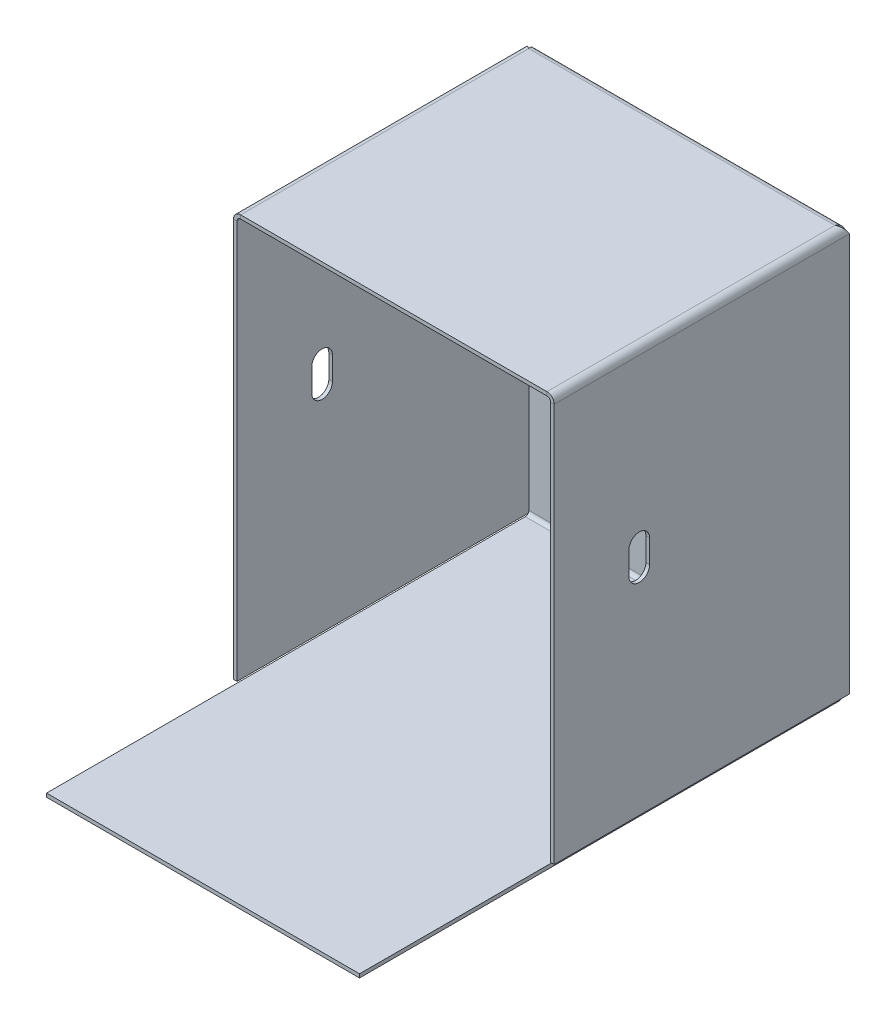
ISO-10303-21;
HEADER;
FILE_DESCRIPTION(('STEP AP214'),'2;1');
FILE_NAME('part.step','',(''),(''),'','','');
FILE_SCHEMA(('AUTOMOTIVE_DESIGN { 1 0 10303 214 1 1 1 1 }'));
ENDSEC;
DATA;
#1=APPLICATION_CONTEXT('core data for automotive mechanical design processes');
#2=APPLICATION_PROTOCOL_DEFINITION('international standard','automotive_design',2000,#1);
#3=PRODUCT_CONTEXT('',#1,'mechanical');
#4=PRODUCT('Part','Part','',(#3));
#5=PRODUCT_RELATED_PRODUCT_CATEGORY('part','',(#4));
#6=PRODUCT_DEFINITION_FORMATION('','',#4);
#7=PRODUCT_DEFINITION_CONTEXT('part definition',#1,'design');
#8=PRODUCT_DEFINITION('design','',#6,#7);
#9=PRODUCT_DEFINITION_SHAPE('','',#8);
#10=(LENGTH_UNIT() NAMED_UNIT(*) SI_UNIT(.MILLI.,.METRE.));
#11=(NAMED_UNIT(*) PLANE_ANGLE_UNIT() SI_UNIT($,.RADIAN.));
#12=(NAMED_UNIT(*) SI_UNIT($,.STERADIAN.) SOLID_ANGLE_UNIT());
#13=UNCERTAINTY_MEASURE_WITH_UNIT(LENGTH_MEASURE(1.E-05),#10,'distance_accuracy_value','');
#14=(GEOMETRIC_REPRESENTATION_CONTEXT(3) GLOBAL_UNCERTAINTY_ASSIGNED_CONTEXT((#13)) GLOBAL_UNIT_ASSIGNED_CONTEXT((#10,
#11,#12)) REPRESENTATION_CONTEXT('',''));
#15=CARTESIAN_POINT('',(0.,0.,0.));
#16=DIRECTION('',(0.,0.,1.));
#17=DIRECTION('',(1.,0.,0.));
#18=AXIS2_PLACEMENT_3D('',#15,#16,#17);
#19=CARTESIAN_POINT('',(-62.9999999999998,-1.49999999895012,-1.50000000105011));
#20=DIRECTION('',(0.,0.,1.));
#21=DIRECTION('',(0.,-1.,0.));
#22=AXIS2_PLACEMENT_3D('',#19,#20,#21);
#23=PLANE('',#22);
#24=DIRECTION('',(1.,0.,0.));
#25=VECTOR('',#24,1.);
#26=CARTESIAN_POINT('',(64.4000000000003,-165.99999999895,-1.50000000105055));
#27=LINE('',#26,#25);
#28=CARTESIAN_POINT('',(64.4000000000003,-165.99999999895,-1.50000000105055));
#29=VERTEX_POINT('',#28);
#30=CARTESIAN_POINT('',(-64.3999999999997,-165.99999999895,-1.50000000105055));
#31=VERTEX_POINT('',#30);
#32=EDGE_CURVE('E413',#29,#31,#27,.F.);
#33=ORIENTED_EDGE('',*,*,#32,.T.);
#34=DIRECTION('',(0.,-1.,0.));
#35=VECTOR('',#34,1.);
#36=CARTESIAN_POINT('',(-64.3999999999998,-2.99999999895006,-1.50000000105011));
#37=LINE('',#36,#35);
#38=CARTESIAN_POINT('',(-64.3999999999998,-3.00000000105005,-1.49999999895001));
#39=VERTEX_POINT('',#38);
#40=EDGE_CURVE('E454',#39,#31,#37,.T.);
#41=ORIENTED_EDGE('',*,*,#40,.F.);
#42=DIRECTION('',(-1.,0.,0.));
#43=VECTOR('',#42,1.);
#44=CARTESIAN_POINT('',(-62.9999999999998,-2.99999999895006,-1.50000000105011));
#45=LINE('',#44,#43);
#46=CARTESIAN_POINT('',(64.4000000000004,-2.99999999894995,-1.50000000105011));
#47=VERTEX_POINT('',#46);
#48=EDGE_CURVE('E441',#47,#39,#45,.T.);
#49=ORIENTED_EDGE('',*,*,#48,.F.);
#50=DIRECTION('',(0.,-1.,0.));
#51=VECTOR('',#50,1.);
#52=CARTESIAN_POINT('',(64.4000000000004,-2.99999999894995,-1.50000000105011));
#53=LINE('',#52,#51);
#54=EDGE_CURVE('E637',#47,#29,#53,.T.);
#55=ORIENTED_EDGE('',*,*,#54,.T.);
#56=EDGE_LOOP('',(#33,#41,#49,#55));
#57=FACE_BOUND('',#56,.T.);
#58=ADVANCED_FACE('F112',(#57),#23,.F.);
#59=CARTESIAN_POINT('',(64.4000000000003,-2.99999999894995,-1.05004893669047E-09));
#60=DIRECTION('',(1.,0.,0.));
#61=DIRECTION('',(0.,0.,-1.));
#62=AXIS2_PLACEMENT_3D('',#59,#60,#61);
#63=PLANE('',#62);
#64=DIRECTION('',(0.,-1.,0.));
#65=VECTOR('',#64,1.);
#66=CARTESIAN_POINT('',(64.4000000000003,-2.99999999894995,-1.05004893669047E-09));
#67=LINE('',#66,#65);
#68=CARTESIAN_POINT('',(64.4000000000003,-2.99999999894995,-1.05004893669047E-09));
#69=VERTEX_POINT('',#68);
#70=CARTESIAN_POINT('',(64.4000000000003,-165.99999999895,-1.05071507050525E-09));
#71=VERTEX_POINT('',#70);
#72=EDGE_CURVE('E640',#69,#71,#67,.T.);
#73=ORIENTED_EDGE('',*,*,#72,.T.);
#74=DIRECTION('',(0.,0.,-1.));
#75=VECTOR('',#74,1.);
#76=CARTESIAN_POINT('',(64.4000000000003,-165.99999999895,-1.05071507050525E-09));
#77=LINE('',#76,#75);
#78=EDGE_CURVE('E422',#71,#29,#77,.T.);
#79=ORIENTED_EDGE('',*,*,#78,.T.);
#80=ORIENTED_EDGE('',*,*,#54,.F.);
#81=CARTESIAN_POINT('',(64.4000000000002,-3.,1.05004893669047E-09));
#82=CARTESIAN_POINT('',(64.4000000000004,-3.,-1.49999999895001));
#83=B_SPLINE_CURVE_WITH_KNOTS('',1,(#81,#82),.UNSPECIFIED.,.F.,.F.,(2,2),(0.,1.),.UNSPECIFIED.);
#84=EDGE_CURVE('E641',#69,#47,#83,.T.);
#85=ORIENTED_EDGE('',*,*,#84,.F.);
#86=EDGE_LOOP('',(#73,#79,#80,#85));
#87=FACE_BOUND('',#86,.T.);
#88=ADVANCED_FACE('F653',(#87),#63,.T.);
#89=CARTESIAN_POINT('',(-62.9999999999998,-1.49999999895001,-1.05004893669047E-09));
#90=DIRECTION('',(0.,0.,1.));
#91=DIRECTION('',(0.,-1.,0.));
#92=AXIS2_PLACEMENT_3D('',#89,#90,#91);
#93=PLANE('',#92);
#94=DIRECTION('',(0.,-1.,0.));
#95=VECTOR('',#94,1.);
#96=CARTESIAN_POINT('',(-64.3999999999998,-2.99999999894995,-1.05004893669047E-09));
#97=LINE('',#96,#95);
#98=CARTESIAN_POINT('',(-64.3999999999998,-2.99999999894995,-1.05004893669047E-09));
#99=VERTEX_POINT('',#98);
#100=CARTESIAN_POINT('',(-64.3999999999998,-165.99999999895,-1.05071507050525E-09));
#101=VERTEX_POINT('',#100);
#102=EDGE_CURVE('E1104',#99,#101,#97,.T.);
#103=ORIENTED_EDGE('',*,*,#102,.T.);
#104=DIRECTION('',(1.,0.,0.));
#105=VECTOR('',#104,1.);
#106=CARTESIAN_POINT('',(64.4000000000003,-165.99999999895,-1.05071507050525E-09));
#107=LINE('',#106,#105);
#108=EDGE_CURVE('E430',#71,#101,#107,.F.);
#109=ORIENTED_EDGE('',*,*,#108,.F.);
#110=ORIENTED_EDGE('',*,*,#72,.F.);
#111=DIRECTION('',(1.,0.,0.));
#112=VECTOR('',#111,1.);
#113=CARTESIAN_POINT('',(-62.9999999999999,-2.99999999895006,-1.05004893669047E-09));
#114=LINE('',#113,#112);
#115=EDGE_CURVE('E1074',#99,#69,#114,.T.);
#116=ORIENTED_EDGE('',*,*,#115,.F.);
#117=EDGE_LOOP('',(#103,#109,#110,#116));
#118=FACE_BOUND('',#117,.T.);
#119=ADVANCED_FACE('F467',(#118),#93,.T.);
#120=CARTESIAN_POINT('',(-64.3999999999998,-2.99999999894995,-1.05004893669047E-09));
#121=DIRECTION('',(1.,0.,0.));
#122=DIRECTION('',(0.,0.,-1.));
#123=AXIS2_PLACEMENT_3D('',#120,#121,#122);
#124=PLANE('',#123);
#125=DIRECTION('',(0.,0.,-1.));
#126=VECTOR('',#125,1.);
#127=CARTESIAN_POINT('',(-64.3999999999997,-165.99999999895,-1.05071507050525E-09));
#128=LINE('',#127,#126);
#129=EDGE_CURVE('E437',#101,#31,#128,.T.);
#130=ORIENTED_EDGE('',*,*,#129,.F.);
#131=ORIENTED_EDGE('',*,*,#102,.F.);
#132=CARTESIAN_POINT('',(-64.3999999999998,-3.00000000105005,-1.49999999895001));
#133=CARTESIAN_POINT('',(-64.3999999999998,-3.00000000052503,1.05004893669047E-09));
#134=B_SPLINE_CURVE_WITH_KNOTS('',1,(#132,#133),.UNSPECIFIED.,.F.,.F.,(2,2),(0.,1.),.UNSPECIFIED.);
#135=EDGE_CURVE('E448',#99,#39,#134,.F.);
#136=ORIENTED_EDGE('',*,*,#135,.T.);
#137=ORIENTED_EDGE('',*,*,#40,.T.);
#138=EDGE_LOOP('',(#130,#131,#136,#137));
#139=FACE_BOUND('',#138,.T.);
#140=ADVANCED_FACE('F456',(#139),#124,.F.);
#141=CARTESIAN_POINT('',(-65.9999999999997,2.22044604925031E-13,120.));
#142=DIRECTION('',(0.,1.,0.));
#143=DIRECTION('',(0.,0.,1.));
#144=AXIS2_PLACEMENT_3D('',#141,#142,#143);
#145=PLANE('',#144);
#146=DIRECTION('',(0.,0.,-1.));
#147=VECTOR('',#146,1.);
#148=CARTESIAN_POINT('',(63.0000000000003,3.33066907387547E-13,120.));
#149=LINE('',#148,#147);
#150=CARTESIAN_POINT('',(63.0000000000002,-2.0996537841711E-09,120.));
#151=VERTEX_POINT('',#150);
#152=CARTESIAN_POINT('',(63.0000000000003,0.,1.50000000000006));
#153=VERTEX_POINT('',#152);
#154=EDGE_CURVE('E772',#151,#153,#149,.T.);
#155=ORIENTED_EDGE('',*,*,#154,.T.);
#156=DIRECTION('',(-1.,0.,0.));
#157=VECTOR('',#156,1.);
#158=CARTESIAN_POINT('',(63.0000000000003,0.,1.50000000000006));
#159=LINE('',#158,#157);
#160=CARTESIAN_POINT('',(-62.9999999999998,-1.05004893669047E-09,1.50000000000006));
#161=VERTEX_POINT('',#160);
#162=EDGE_CURVE('E756',#153,#161,#159,.T.);
#163=ORIENTED_EDGE('',*,*,#162,.T.);
#164=DIRECTION('',(0.,0.,-1.));
#165=VECTOR('',#164,1.);
#166=CARTESIAN_POINT('',(-62.9999999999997,0.,120.));
#167=LINE('',#166,#165);
#168=CARTESIAN_POINT('',(-62.9999999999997,0.,120.));
#169=VERTEX_POINT('',#168);
#170=EDGE_CURVE('E923',#169,#161,#167,.T.);
#171=ORIENTED_EDGE('',*,*,#170,.F.);
#172=DIRECTION('',(1.,0.,0.));
#173=VECTOR('',#172,1.);
#174=CARTESIAN_POINT('',(-65.9999999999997,2.22044604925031E-13,120.));
#175=LINE('',#174,#173);
#176=EDGE_CURVE('E835',#169,#151,#175,.T.);
#177=ORIENTED_EDGE('',*,*,#176,.T.);
#178=EDGE_LOOP('',(#155,#163,#171,#177));
#179=FACE_BOUND('',#178,.T.);
#180=ADVANCED_FACE('F466',(#179),#145,.T.);
#181=CARTESIAN_POINT('',(-65.9999999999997,-1.49999999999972,120.));
#182=DIRECTION('',(0.,1.,0.));
#183=DIRECTION('',(0.,0.,1.));
#184=AXIS2_PLACEMENT_3D('',#181,#182,#183);
#185=PLANE('',#184);
#186=DIRECTION('',(-1.,0.,0.));
#187=VECTOR('',#186,1.);
#188=CARTESIAN_POINT('',(63.0000000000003,-1.49999999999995,1.50000000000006));
#189=LINE('',#188,#187);
#190=CARTESIAN_POINT('',(63.0000000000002,-1.50000000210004,1.50000000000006));
#191=VERTEX_POINT('',#190);
#192=CARTESIAN_POINT('',(-62.9999999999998,-1.50000000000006,1.50000000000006));
#193=VERTEX_POINT('',#192);
#194=EDGE_CURVE('E743',#191,#193,#189,.T.);
#195=ORIENTED_EDGE('',*,*,#194,.F.);
#196=DIRECTION('',(0.,0.,-1.));
#197=VECTOR('',#196,1.);
#198=CARTESIAN_POINT('',(63.0000000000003,-1.49999999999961,120.));
#199=LINE('',#198,#197);
#200=CARTESIAN_POINT('',(63.0000000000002,-1.50000000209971,120.));
#201=VERTEX_POINT('',#200);
#202=EDGE_CURVE('E764',#201,#191,#199,.T.);
#203=ORIENTED_EDGE('',*,*,#202,.F.);
#204=DIRECTION('',(1.,0.,0.));
#205=VECTOR('',#204,1.);
#206=CARTESIAN_POINT('',(-65.9999999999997,-1.49999999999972,120.));
#207=LINE('',#206,#205);
#208=CARTESIAN_POINT('',(-62.9999999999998,-1.49999999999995,120.));
#209=VERTEX_POINT('',#208);
#210=EDGE_CURVE('E931',#209,#201,#207,.T.);
#211=ORIENTED_EDGE('',*,*,#210,.F.);
#212=DIRECTION('',(0.,0.,-1.));
#213=VECTOR('',#212,1.);
#214=CARTESIAN_POINT('',(-62.9999999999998,-1.49999999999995,120.));
#215=LINE('',#214,#213);
#216=EDGE_CURVE('E922',#209,#193,#215,.T.);
#217=ORIENTED_EDGE('',*,*,#216,.T.);
#218=EDGE_LOOP('',(#195,#203,#211,#217));
#219=FACE_BOUND('',#218,.T.);
#220=ADVANCED_FACE('F901',(#219),#185,.F.);
#221=CARTESIAN_POINT('',(-64.4999999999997,-2.99999999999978,120.));
#222=DIRECTION('',(0.,0.,1.));
#223=DIRECTION('',(1.,0.,0.));
#224=AXIS2_PLACEMENT_3D('',#221,#222,#223);
#225=PLANE('',#224);
#226=ORIENTED_EDGE('',*,*,#176,.F.);
#227=DIRECTION('',(0.,-1.,0.));
#228=VECTOR('',#227,1.);
#229=CARTESIAN_POINT('',(-62.9999999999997,0.,120.));
#230=LINE('',#229,#228);
#231=EDGE_CURVE('E775',#169,#209,#230,.T.);
#232=ORIENTED_EDGE('',*,*,#231,.T.);
#233=ORIENTED_EDGE('',*,*,#210,.T.);
#234=DIRECTION('',(0.,1.,0.));
#235=VECTOR('',#234,1.);
#236=CARTESIAN_POINT('',(63.0000000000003,-1.49999999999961,120.));
#237=LINE('',#236,#235);
#238=EDGE_CURVE('E769',#201,#151,#237,.T.);
#239=ORIENTED_EDGE('',*,*,#238,.T.);
#240=EDGE_LOOP('',(#226,#232,#233,#239));
#241=FACE_BOUND('',#240,.T.);
#242=ADVANCED_FACE('F114',(#241),#225,.T.);
#243=CARTESIAN_POINT('',(-64.4999999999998,-167.,120.));
#244=DIRECTION('',(0.,-1.,0.));
#245=DIRECTION('',(0.,0.,-1.));
#246=AXIS2_PLACEMENT_3D('',#243,#244,#245);
#247=PLANE('',#246);
#248=DIRECTION('',(0.,0.,-1.));
#249=VECTOR('',#248,1.);
#250=CARTESIAN_POINT('',(-65.9999999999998,-167.,120.));
#251=LINE('',#250,#249);
#252=CARTESIAN_POINT('',(-65.9999999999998,-167.,120.));
#253=VERTEX_POINT('',#252);
#254=CARTESIAN_POINT('',(-65.9999999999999,-167.,-1.50000000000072));
#255=VERTEX_POINT('',#254);
#256=EDGE_CURVE('E859',#253,#255,#251,.T.);
#257=ORIENTED_EDGE('',*,*,#256,.T.);
#258=DIRECTION('',(1.,0.,0.));
#259=VECTOR('',#258,1.);
#260=CARTESIAN_POINT('',(-65.9999999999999,-167.,-1.50000000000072));
#261=LINE('',#260,#259);
#262=CARTESIAN_POINT('',(-64.4999999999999,-167.,-1.50000000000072));
#263=VERTEX_POINT('',#262);
#264=EDGE_CURVE('E855',#255,#263,#261,.T.);
#265=ORIENTED_EDGE('',*,*,#264,.T.);
#266=DIRECTION('',(0.,0.,-1.));
#267=VECTOR('',#266,1.);
#268=CARTESIAN_POINT('',(-64.4999999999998,-167.,120.));
#269=LINE('',#268,#267);
#270=CARTESIAN_POINT('',(-64.4999999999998,-167.,120.));
#271=VERTEX_POINT('',#270);
#272=EDGE_CURVE('E840',#271,#263,#269,.T.);
#273=ORIENTED_EDGE('',*,*,#272,.F.);
#274=DIRECTION('',(-1.,0.,0.));
#275=VECTOR('',#274,1.);
#276=CARTESIAN_POINT('',(-64.4999999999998,-167.,120.));
#277=LINE('',#276,#275);
#278=EDGE_CURVE('E850',#271,#253,#277,.T.);
#279=ORIENTED_EDGE('',*,*,#278,.T.);
#280=EDGE_LOOP('',(#257,#265,#273,#279));
#281=FACE_BOUND('',#280,.T.);
#282=ADVANCED_FACE('F1153',(#281),#247,.T.);
#283=CARTESIAN_POINT('',(-65.9999999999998,-167.,120.));
#284=DIRECTION('',(-1.,0.,0.));
#285=DIRECTION('',(0.,0.,1.));
#286=AXIS2_PLACEMENT_3D('',#283,#284,#285);
#287=PLANE('',#286);
#288=CARTESIAN_POINT('',(-65.9999999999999,-70.2499999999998,85.));
#289=DIRECTION('',(-1.,0.,0.));
#290=DIRECTION('',(0.,0.,1.));
#291=AXIS2_PLACEMENT_3D('',#288,#289,#290);
#292=CIRCLE('',#291,4.25);
#293=CARTESIAN_POINT('',(-65.9999999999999,-70.2499999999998,89.2500000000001));
#294=VERTEX_POINT('',#293);
#295=CARTESIAN_POINT('',(-65.9999999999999,-70.2500000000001,80.7499999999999));
#296=VERTEX_POINT('',#295);
#297=EDGE_CURVE('E367',#294,#296,#292,.T.);
#298=ORIENTED_EDGE('',*,*,#297,.F.);
#299=DIRECTION('',(0.,1.,0.));
#300=VECTOR('',#299,1.);
#301=CARTESIAN_POINT('',(-65.9999999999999,-167.,89.2499999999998));
#302=LINE('',#301,#300);
#303=CARTESIAN_POINT('',(-65.9999999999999,-79.7499999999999,89.2500000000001));
#304=VERTEX_POINT('',#303);
#305=EDGE_CURVE('E346',#304,#294,#302,.T.);
#306=ORIENTED_EDGE('',*,*,#305,.F.);
#307=CARTESIAN_POINT('',(-65.9999999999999,-79.7499999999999,85.));
#308=DIRECTION('',(-1.,0.,0.));
#309=DIRECTION('',(0.,0.,1.));
#310=AXIS2_PLACEMENT_3D('',#307,#308,#309);
#311=CIRCLE('',#310,4.25);
#312=CARTESIAN_POINT('',(-65.9999999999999,-79.75,80.7499999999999));
#313=VERTEX_POINT('',#312);
#314=EDGE_CURVE('E353',#313,#304,#311,.T.);
#315=ORIENTED_EDGE('',*,*,#314,.F.);
#316=DIRECTION('',(0.,-1.,0.));
#317=VECTOR('',#316,1.);
#318=CARTESIAN_POINT('',(-65.9999999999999,-167.,80.7499999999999));
#319=LINE('',#318,#317);
#320=EDGE_CURVE('E360',#296,#313,#319,.T.);
#321=ORIENTED_EDGE('',*,*,#320,.F.);
#322=EDGE_LOOP('',(#298,#306,#315,#321));
#323=FACE_BOUND('',#322,.T.);
#324=DIRECTION('',(0.,0.,-1.));
#325=VECTOR('',#324,1.);
#326=CARTESIAN_POINT('',(-65.9999999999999,-2.99999999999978,120.));
#327=LINE('',#326,#325);
#328=CARTESIAN_POINT('',(-65.9999999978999,-2.99999999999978,120.));
#329=VERTEX_POINT('',#328);
#330=CARTESIAN_POINT('',(-65.9999999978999,-3.00000000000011,-1.50000000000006));
#331=VERTEX_POINT('',#330);
#332=EDGE_CURVE('E854',#329,#331,#327,.T.);
#333=ORIENTED_EDGE('',*,*,#332,.T.);
#334=DIRECTION('',(0.,-1.,0.));
#335=VECTOR('',#334,1.);
#336=CARTESIAN_POINT('',(-65.9999999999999,-3.00000000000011,-1.50000000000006));
#337=LINE('',#336,#335);
#338=EDGE_CURVE('E849',#331,#255,#337,.T.);
#339=ORIENTED_EDGE('',*,*,#338,.T.);
#340=ORIENTED_EDGE('',*,*,#256,.F.);
#341=DIRECTION('',(0.,1.,0.));
#342=VECTOR('',#341,1.);
#343=CARTESIAN_POINT('',(-65.9999999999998,-167.,120.));
#344=LINE('',#343,#342);
#345=EDGE_CURVE('E844',#253,#329,#344,.T.);
#346=ORIENTED_EDGE('',*,*,#345,.T.);
#347=EDGE_LOOP('',(#333,#339,#340,#346));
#348=FACE_BOUND('',#347,.T.);
#349=ADVANCED_FACE('F894',(#323,#348),#287,.T.);
#350=CARTESIAN_POINT('',(-65.9999999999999,-3.00000000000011,-1.50000000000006));
#351=DIRECTION('',(0.,0.,1.));
#352=DIRECTION('',(0.,-1.,0.));
#353=AXIS2_PLACEMENT_3D('',#350,#351,#352);
#354=PLANE('',#353);
#355=DIRECTION('',(0.,-1.,0.));
#356=VECTOR('',#355,1.);
#357=CARTESIAN_POINT('',(-64.4999999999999,-3.00000000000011,-1.50000000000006));
#358=LINE('',#357,#356);
#359=CARTESIAN_POINT('',(-64.4999999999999,-3.00000000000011,-1.50000000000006));
#360=VERTEX_POINT('',#359);
#361=EDGE_CURVE('E848',#360,#263,#358,.T.);
#362=ORIENTED_EDGE('',*,*,#361,.T.);
#363=ORIENTED_EDGE('',*,*,#264,.F.);
#364=ORIENTED_EDGE('',*,*,#338,.F.);
#365=CARTESIAN_POINT('',(-64.4849999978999,-3.00000000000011,-1.50000000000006));
#366=CARTESIAN_POINT('',(-64.4999999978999,-3.00000000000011,-1.50000000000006));
#367=CARTESIAN_POINT('',(-65.9999999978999,-3.00000000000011,-1.50000000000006));
#368=CARTESIAN_POINT('',(-66.0151499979,-3.00000000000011,-1.50000000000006));
#369=B_SPLINE_CURVE_WITH_KNOTS('',1,(#365,#366,#367,#368),.UNSPECIFIED.,.F.,.F.,(2,1,1,2),
(-0.0101,-9.9999999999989E-05,0.9999,1.01),.UNSPECIFIED.);
#370=EDGE_CURVE('E843',#331,#360,#369,.F.);
#371=ORIENTED_EDGE('',*,*,#370,.T.);
#372=EDGE_LOOP('',(#362,#363,#364,#371));
#373=FACE_BOUND('',#372,.T.);
#374=ADVANCED_FACE('F883',(#373),#354,.F.);
#375=CARTESIAN_POINT('',(-64.4999999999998,-167.,120.));
#376=DIRECTION('',(-1.,0.,0.));
#377=DIRECTION('',(0.,0.,1.));
#378=AXIS2_PLACEMENT_3D('',#375,#376,#377);
#379=PLANE('',#378);
#380=DIRECTION('',(0.,1.,0.));
#381=VECTOR('',#380,1.);
#382=CARTESIAN_POINT('',(-64.4999999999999,-167.,89.2500000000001));
#383=LINE('',#382,#381);
#384=CARTESIAN_POINT('',(-64.4999999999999,-79.7499999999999,89.2500000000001));
#385=VERTEX_POINT('',#384);
#386=CARTESIAN_POINT('',(-64.4999999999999,-70.2499999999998,89.2500000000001));
#387=VERTEX_POINT('',#386);
#388=EDGE_CURVE('E342',#385,#387,#383,.T.);
#389=ORIENTED_EDGE('',*,*,#388,.T.);
#390=CARTESIAN_POINT('',(-64.4999999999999,-70.2499999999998,85.));
#391=DIRECTION('',(-1.,0.,0.));
#392=DIRECTION('',(0.,0.,1.));
#393=AXIS2_PLACEMENT_3D('',#390,#391,#392);
#394=CIRCLE('',#393,4.25);
#395=CARTESIAN_POINT('',(-64.4999999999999,-70.2500000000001,80.7499999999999));
#396=VERTEX_POINT('',#395);
#397=EDGE_CURVE('E363',#387,#396,#394,.T.);
#398=ORIENTED_EDGE('',*,*,#397,.T.);
#399=DIRECTION('',(0.,-1.,0.));
#400=VECTOR('',#399,1.);
#401=CARTESIAN_POINT('',(-64.4999999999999,-167.,80.7499999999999));
#402=LINE('',#401,#400);
#403=CARTESIAN_POINT('',(-64.4999999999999,-79.75,80.7499999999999));
#404=VERTEX_POINT('',#403);
#405=EDGE_CURVE('E356',#396,#404,#402,.T.);
#406=ORIENTED_EDGE('',*,*,#405,.T.);
#407=CARTESIAN_POINT('',(-64.4999999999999,-79.7499999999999,85.));
#408=DIRECTION('',(-1.,0.,0.));
#409=DIRECTION('',(0.,0.,1.));
#410=AXIS2_PLACEMENT_3D('',#407,#408,#409);
#411=CIRCLE('',#410,4.25);
#412=EDGE_CURVE('E349',#404,#385,#411,.T.);
#413=ORIENTED_EDGE('',*,*,#412,.T.);
#414=EDGE_LOOP('',(#389,#398,#406,#413));
#415=FACE_BOUND('',#414,.T.);
#416=ORIENTED_EDGE('',*,*,#272,.T.);
#417=ORIENTED_EDGE('',*,*,#361,.F.);
#418=DIRECTION('',(0.,0.,-1.));
#419=VECTOR('',#418,1.);
#420=CARTESIAN_POINT('',(-64.4999999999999,-2.99999999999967,120.));
#421=LINE('',#420,#419);
#422=CARTESIAN_POINT('',(-64.4999999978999,-2.99999999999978,120.));
#423=VERTEX_POINT('',#422);
#424=EDGE_CURVE('E862',#423,#360,#421,.T.);
#425=ORIENTED_EDGE('',*,*,#424,.F.);
#426=DIRECTION('',(0.,1.,0.));
#427=VECTOR('',#426,1.);
#428=CARTESIAN_POINT('',(-64.4999999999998,-167.,120.));
#429=LINE('',#428,#427);
#430=EDGE_CURVE('E836',#271,#423,#429,.T.);
#431=ORIENTED_EDGE('',*,*,#430,.F.);
#432=EDGE_LOOP('',(#416,#417,#425,#431));
#433=FACE_BOUND('',#432,.T.);
#434=ADVANCED_FACE('F893',(#415,#433),#379,.F.);
#435=CARTESIAN_POINT('',(63.0000000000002,-2.99999999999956,120.));
#436=DIRECTION('',(0.,0.,1.));
#437=DIRECTION('',(1.,0.,0.));
#438=AXIS2_PLACEMENT_3D('',#435,#436,#437);
#439=PLANE('',#438);
#440=ORIENTED_EDGE('',*,*,#430,.T.);
#441=DIRECTION('',(-1.,0.,0.));
#442=VECTOR('',#441,1.);
#443=CARTESIAN_POINT('',(-64.4999999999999,-2.99999999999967,120.));
#444=LINE('',#443,#442);
#445=EDGE_CURVE('E826',#423,#329,#444,.T.);
#446=ORIENTED_EDGE('',*,*,#445,.T.);
#447=ORIENTED_EDGE('',*,*,#345,.F.);
#448=ORIENTED_EDGE('',*,*,#278,.F.);
#449=EDGE_LOOP('',(#440,#446,#447,#448));
#450=FACE_BOUND('',#449,.T.);
#451=ADVANCED_FACE('F799',(#450),#439,.T.);
#452=CARTESIAN_POINT('',(-62.9999999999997,0.0151499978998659,1.50000000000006));
#453=CARTESIAN_POINT('',(-63.3947329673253,0.015149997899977,1.2499677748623));
#454=CARTESIAN_POINT('',(-63.789209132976,-0.0633262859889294,0.99999999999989));
#455=CARTESIAN_POINT('',(-64.5184867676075,-0.365402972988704,0.499999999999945));
#456=CARTESIAN_POINT('',(-64.8529505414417,-0.588884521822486,0.250000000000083));
#457=CARTESIAN_POINT('',(-65.4111154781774,-1.14704945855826,-0.250000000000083));
#458=CARTESIAN_POINT('',(-65.6345970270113,-1.48151323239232,-0.499999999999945));
#459=CARTESIAN_POINT('',(-65.9366737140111,-2.2107908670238,-0.99999999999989));
#460=CARTESIAN_POINT('',(-66.0151499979,-2.6052670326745,-1.2499677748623));
#461=CARTESIAN_POINT('',(-66.0151499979,-3.00000000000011,-1.50000000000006));
#462=CARTESIAN_POINT('',(-62.9999999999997,-2.10009787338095E-09,1.50000000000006));
#463=CARTESIAN_POINT('',(-63.3927494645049,-2.10009787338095E-09,1.24996792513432));
#464=CARTESIAN_POINT('',(-63.785243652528,-0.0780819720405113,0.99999999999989));
#465=CARTESIAN_POINT('',(-64.5108569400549,-0.378640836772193,0.499999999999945));
#466=CARTESIAN_POINT('',(-64.8436401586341,-0.600999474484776,0.250000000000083));
#467=CARTESIAN_POINT('',(-65.3990005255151,-1.15635984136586,-0.250000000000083));
#468=CARTESIAN_POINT('',(-65.6213591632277,-1.48914305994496,-0.499999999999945));
#469=CARTESIAN_POINT('',(-65.9219180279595,-2.21475634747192,-0.99999999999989));
#470=CARTESIAN_POINT('',(-65.9999999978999,-2.60725053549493,-1.24996792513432));
#471=CARTESIAN_POINT('',(-65.9999999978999,-3.00000000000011,-1.50000000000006));
#472=CARTESIAN_POINT('',(-62.9999999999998,-1.50000000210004,1.50000000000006));
#473=CARTESIAN_POINT('',(-63.1963630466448,-1.50000000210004,1.24998280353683));
#474=CARTESIAN_POINT('',(-63.3926218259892,-1.53904098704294,0.99999999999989));
#475=CARTESIAN_POINT('',(-63.7554284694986,-1.68932041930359,0.499999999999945));
#476=CARTESIAN_POINT('',(-63.9218200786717,-1.80049973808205,0.250000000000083));
#477=CARTESIAN_POINT('',(-64.1995002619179,-2.07817992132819,-0.250000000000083));
#478=CARTESIAN_POINT('',(-64.3106795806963,-2.24457153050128,-0.499999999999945));
#479=CARTESIAN_POINT('',(-64.460959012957,-2.6073781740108,-0.99999999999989));
#480=CARTESIAN_POINT('',(-64.4999999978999,-2.80363695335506,-1.24998280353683));
#481=CARTESIAN_POINT('',(-64.4999999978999,-3.00000000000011,-1.50000000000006));
#482=CARTESIAN_POINT('',(-62.9999999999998,-1.51500000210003,1.50000000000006));
#483=CARTESIAN_POINT('',(-63.1943991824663,-1.51500000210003,1.24998295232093));
#484=CARTESIAN_POINT('',(-63.3886956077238,-1.55365057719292,0.99999999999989));
#485=CARTESIAN_POINT('',(-63.7478741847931,-1.70242721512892,0.499999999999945));
#486=CARTESIAN_POINT('',(-63.9126018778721,-1.8124947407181,0.250000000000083));
#487=CARTESIAN_POINT('',(-64.1875052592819,-2.08739812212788,-0.250000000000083));
#488=CARTESIAN_POINT('',(-64.2975727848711,-2.25212581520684,-0.499999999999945));
#489=CARTESIAN_POINT('',(-64.4463494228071,-2.61130439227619,-0.99999999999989));
#490=CARTESIAN_POINT('',(-64.4849999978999,-2.80560081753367,-1.24998295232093));
#491=CARTESIAN_POINT('',(-64.4849999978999,-3.00000000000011,-1.50000000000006));
#492=B_SPLINE_SURFACE_WITH_KNOTS('',1,3,((#452,#453,#454,#455,#456,#457,#458,#459,#460,#461),
(#462,#463,#464,#465,#466,#467,#468,#469,#470,#471),(#472,#473,#474,#475,#476,#477,#478,#479,
#480,#481),(#482,#483,#484,#485,#486,#487,#488,#489,#490,#491)),.UNSPECIFIED.,.F.,.F.,.F.,(2,1,
1,2),(4,2,2,2,4),(-0.0101,0.,1.,1.01),(0.,0.25,0.5,0.75,1.),.UNSPECIFIED.);
#493=CARTESIAN_POINT('',(-62.9999999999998,-1.50000000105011,1.50000000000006));
#494=CARTESIAN_POINT('',(-62.9999999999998,-1.05004893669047E-09,1.50000000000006));
#495=B_SPLINE_CURVE_WITH_KNOTS('',1,(#493,#494),.UNSPECIFIED.,.F.,.F.,(2,2),(0.,1.),.UNSPECIFIED.);
#496=EDGE_CURVE('E738',#193,#161,#495,.T.);
#497=CARTESIAN_POINT('',(-62.9999999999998,-1.50000000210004,1.50000000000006));
#498=CARTESIAN_POINT('',(-63.0685009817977,-1.49996789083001,1.41277857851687));
#499=CARTESIAN_POINT('',(-63.1369990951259,-1.50469068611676,1.32556064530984));
#500=CARTESIAN_POINT('',(-63.2727095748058,-1.52341786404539,1.15113733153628));
#501=CARTESIAN_POINT('',(-63.3399220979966,-1.53742110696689,1.06393195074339));
#502=CARTESIAN_POINT('',(-63.4715792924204,-1.57441936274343,0.889808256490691));
#503=CARTESIAN_POINT('',(-63.5360324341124,-1.59738428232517,0.802889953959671));
#504=CARTESIAN_POINT('',(-63.6612123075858,-1.65186945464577,0.62905729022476));
#505=CARTESIAN_POINT('',(-63.7219391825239,-1.68338937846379,0.542142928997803));
#506=CARTESIAN_POINT('',(-63.8388650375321,-1.75460158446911,0.367834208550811));
#507=CARTESIAN_POINT('',(-63.8950369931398,-1.79433828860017,0.28043986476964));
#508=CARTESIAN_POINT('',(-64.0014103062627,-1.88112140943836,0.105646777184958));
#509=CARTESIAN_POINT('',(-64.0516116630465,-1.92816782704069,0.0182480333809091));
#510=CARTESIAN_POINT('',(-64.1450910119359,-2.02867350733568,-0.156519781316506));
#511=CARTESIAN_POINT('',(-64.1883711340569,-2.08213078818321,-0.243888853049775));
#512=CARTESIAN_POINT('',(-64.2672076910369,-2.19446194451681,-0.418617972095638));
#513=CARTESIAN_POINT('',(-64.3027650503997,-2.25333517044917,-0.505978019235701));
#514=CARTESIAN_POINT('',(-64.3612222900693,-2.3670786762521,-0.668808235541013));
#515=CARTESIAN_POINT('',(-64.3851859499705,-2.42140431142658,-0.744279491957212));
#516=CARTESIAN_POINT('',(-64.4265212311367,-2.53250644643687,-0.895217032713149));
#517=CARTESIAN_POINT('',(-64.4438934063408,-2.58928273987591,-0.970683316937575));
#518=CARTESIAN_POINT('',(-64.4718282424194,-2.704624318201,-1.12178360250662));
#519=CARTESIAN_POINT('',(-64.4823754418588,-2.76319335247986,-1.19741759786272));
#520=CARTESIAN_POINT('',(-64.496470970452,-2.88117477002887,-1.34870002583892));
#521=CARTESIAN_POINT('',(-64.50001812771,-2.94058729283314,-1.42434845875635));
#522=CARTESIAN_POINT('',(-64.4999999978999,-3.00000000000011,-1.50000000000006));
#523=B_SPLINE_CURVE_WITH_KNOTS('',3,(#497,#498,#499,#500,#501,#502,#503,#504,#505,#506,#507,
#508,#509,#510,#511,#512,#513,#514,#515,#516,#517,#518,#519,#520,#521,#522),.UNSPECIFIED.,.F.,
.F.,(4,2,2,2,2,2,2,2,2,2,2,2,4),(0.,0.332608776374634,0.665176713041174,0.99663736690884,
1.32808527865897,1.66137426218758,1.99466328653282,2.3278495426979,2.66099589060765,
2.94883083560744,3.23664158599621,3.52510208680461,3.81361087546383),.UNSPECIFIED.);
#524=EDGE_CURVE('E936',#193,#360,#523,.T.);
#525=CARTESIAN_POINT('',(-62.9999999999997,-2.10009787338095E-09,1.50000000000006));
#526=CARTESIAN_POINT('',(-63.10005399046,1.80178448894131E-05,1.43629999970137));
#527=CARTESIAN_POINT('',(-63.2001065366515,-0.00500460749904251,1.37260253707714));
#528=CARTESIAN_POINT('',(-63.39920744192,-0.0250018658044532,1.24521442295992));
#529=CARTESIAN_POINT('',(-63.4982558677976,-0.0399758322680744,1.18152377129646));
#530=CARTESIAN_POINT('',(-63.6942981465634,-0.0797337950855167,1.05418324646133));
#531=CARTESIAN_POINT('',(-63.7912932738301,-0.104511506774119,0.990533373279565));
#532=CARTESIAN_POINT('',(-63.9823224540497,-0.163622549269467,0.863231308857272));
#533=CARTESIAN_POINT('',(-64.0763565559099,-0.197955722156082,0.799579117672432));
#534=CARTESIAN_POINT('',(-64.2606537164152,-0.275889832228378,0.672187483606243));
#535=CARTESIAN_POINT('',(-64.3509114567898,-0.319503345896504,0.608448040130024));
#536=CARTESIAN_POINT('',(-64.5266511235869,-0.415552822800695,0.480949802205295));
#537=CARTESIAN_POINT('',(-64.6121312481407,-0.467992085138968,0.417191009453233));
#538=CARTESIAN_POINT('',(-64.7773625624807,-0.581115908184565,0.289715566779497));
#539=CARTESIAN_POINT('',(-64.8571176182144,-0.641794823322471,0.225998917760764));
#540=CARTESIAN_POINT('',(-65.0101642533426,-0.770816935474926,0.0985628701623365));
#541=CARTESIAN_POINT('',(-65.0834558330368,-0.839160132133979,0.0348434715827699));
#542=CARTESIAN_POINT('',(-65.2228628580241,-0.982847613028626,-0.0926136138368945));
#543=CARTESIAN_POINT('',(-65.288976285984,-1.05819385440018,-0.156351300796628));
#544=CARTESIAN_POINT('',(-65.4133149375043,-1.21508410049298,-0.283792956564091));
#545=CARTESIAN_POINT('',(-65.4715437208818,-1.29662528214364,-0.347496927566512));
#546=CARTESIAN_POINT('',(-65.5796073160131,-1.46518492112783,-0.474959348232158));
#547=CARTESIAN_POINT('',(-65.6294351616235,-1.55220784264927,-0.538717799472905));
#548=CARTESIAN_POINT('',(-65.7201218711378,-1.73076446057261,-0.666212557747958));
#549=CARTESIAN_POINT('',(-65.7609843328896,-1.82229632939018,-0.729948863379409));
#550=CARTESIAN_POINT('',(-65.830590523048,-2.00184778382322,-0.852548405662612));
#551=CARTESIAN_POINT('',(-65.8600215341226,-2.08960157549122,-0.911411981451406));
#552=CARTESIAN_POINT('',(-65.9106564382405,-2.26745116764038,-1.0291329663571));
#553=CARTESIAN_POINT('',(-65.9318607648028,-2.3575468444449,-1.08799037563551));
#554=CARTESIAN_POINT('',(-65.9658557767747,-2.53930332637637,-1.2057019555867));
#555=CARTESIAN_POINT('',(-65.9786470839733,-2.63096401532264,-1.26455612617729));
#556=CARTESIAN_POINT('',(-65.9957261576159,-2.81508262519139,-1.38227300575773));
#557=CARTESIAN_POINT('',(-66.0000129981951,-2.90754063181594,-1.4411357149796));
#558=CARTESIAN_POINT('',(-65.9999999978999,-3.00000000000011,-1.50000000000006));
#559=B_SPLINE_CURVE_WITH_KNOTS('',3,(#525,#526,#527,#528,#529,#530,#531,#532,#533,#534,#535,
#536,#537,#538,#539,#540,#541,#542,#543,#544,#545,#546,#547,#548,#549,#550,#551,#552,#553,#554,
#555,#556,#557,#558),.UNSPECIFIED.,.F.,.F.,(4,2,2,2,2,2,2,2,2,2,2,2,2,2,2,2,4),(0.,
0.355722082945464,0.711420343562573,1.06689095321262,1.42235568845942,1.77830524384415,
2.1343881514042,2.49022830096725,2.84606843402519,3.20200831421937,3.55778695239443,
3.91385917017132,4.26978823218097,4.59852891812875,4.92725227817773,5.25595134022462,
5.58468618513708),.UNSPECIFIED.);
#560=EDGE_CURVE('E786',#161,#331,#559,.T.);
#561=ORIENTED_EDGE('',*,*,#496,.F.);
#562=ORIENTED_EDGE('',*,*,#524,.T.);
#563=ORIENTED_EDGE('',*,*,#370,.F.);
#564=ORIENTED_EDGE('',*,*,#560,.F.);
#565=EDGE_LOOP('',(#561,#562,#563,#564));
#566=FACE_BOUND('',#565,.T.);
#567=ADVANCED_FACE('F792',(#566),#492,.T.);
#568=CARTESIAN_POINT('',(-63.0000000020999,-3.,120.));
#569=DIRECTION('',(0.,0.,1.));
#570=DIRECTION('',(1.,0.,0.));
#571=AXIS2_PLACEMENT_3D('',#568,#569,#570);
#572=PLANE('',#571);
#573=CARTESIAN_POINT('',(-62.9999999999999,-3.,120.));
#574=DIRECTION('',(0.,0.,-1.));
#575=DIRECTION('',(-1.,0.,0.));
#576=AXIS2_PLACEMENT_3D('',#573,#574,#575);
#577=CIRCLE('',#576,1.49999999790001);
#578=EDGE_CURVE('E938',#423,#209,#577,.T.);
#579=ORIENTED_EDGE('',*,*,#578,.T.);
#580=ORIENTED_EDGE('',*,*,#231,.F.);
#581=CARTESIAN_POINT('',(-63.0000000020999,-3.,120.));
#582=DIRECTION('',(0.,0.,-1.));
#583=DIRECTION('',(-1.,0.,0.));
#584=AXIS2_PLACEMENT_3D('',#581,#582,#583);
#585=CIRCLE('',#584,2.99999999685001);
#586=EDGE_CURVE('E866',#329,#169,#585,.T.);
#587=ORIENTED_EDGE('',*,*,#586,.F.);
#588=ORIENTED_EDGE('',*,*,#445,.F.);
#589=EDGE_LOOP('',(#579,#580,#587,#588));
#590=FACE_BOUND('',#589,.T.);
#591=ADVANCED_FACE('F798',(#590),#572,.T.);
#592=CARTESIAN_POINT('',(-62.9999999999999,-3.,180.850602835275));
#593=DIRECTION('',(0.,0.,-1.));
#594=DIRECTION('',(-1.,0.,0.));
#595=AXIS2_PLACEMENT_3D('',#592,#593,#594);
#596=CYLINDRICAL_SURFACE('',#595,2.9999999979);
#597=ORIENTED_EDGE('',*,*,#332,.F.);
#598=ORIENTED_EDGE('',*,*,#586,.T.);
#599=ORIENTED_EDGE('',*,*,#170,.T.);
#600=ORIENTED_EDGE('',*,*,#560,.T.);
#601=EDGE_LOOP('',(#597,#598,#599,#600));
#602=FACE_BOUND('',#601,.T.);
#603=ADVANCED_FACE('F788',(#602),#596,.T.);
#604=CARTESIAN_POINT('',(-62.9999999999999,-3.,180.850602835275));
#605=DIRECTION('',(0.,0.,-1.));
#606=DIRECTION('',(-1.,0.,0.));
#607=AXIS2_PLACEMENT_3D('',#604,#605,#606);
#608=CYLINDRICAL_SURFACE('',#607,1.49999999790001);
#609=ORIENTED_EDGE('',*,*,#424,.T.);
#610=ORIENTED_EDGE('',*,*,#524,.F.);
#611=ORIENTED_EDGE('',*,*,#216,.F.);
#612=ORIENTED_EDGE('',*,*,#578,.F.);
#613=EDGE_LOOP('',(#609,#610,#611,#612));
#614=FACE_BOUND('',#613,.T.);
#615=ADVANCED_FACE('F801',(#614),#608,.F.);
#616=CARTESIAN_POINT('',(66.0000000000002,-167.,120.));
#617=DIRECTION('',(0.,-1.,0.));
#618=DIRECTION('',(0.,0.,-1.));
#619=AXIS2_PLACEMENT_3D('',#616,#617,#618);
#620=PLANE('',#619);
#621=DIRECTION('',(0.,0.,-1.));
#622=VECTOR('',#621,1.);
#623=CARTESIAN_POINT('',(64.5000000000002,-166.999999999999,120.));
#624=LINE('',#623,#622);
#625=CARTESIAN_POINT('',(64.5000000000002,-166.999999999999,120.));
#626=VERTEX_POINT('',#625);
#627=CARTESIAN_POINT('',(64.5000000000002,-167.,-1.5000000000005));
#628=VERTEX_POINT('',#627);
#629=EDGE_CURVE('E972',#626,#628,#624,.T.);
#630=ORIENTED_EDGE('',*,*,#629,.T.);
#631=DIRECTION('',(-1.,0.,0.));
#632=VECTOR('',#631,1.);
#633=CARTESIAN_POINT('',(66.0000000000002,-167.,-1.5000000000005));
#634=LINE('',#633,#632);
#635=CARTESIAN_POINT('',(66.0000000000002,-167.,-1.5000000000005));
#636=VERTEX_POINT('',#635);
#637=EDGE_CURVE('E921',#636,#628,#634,.T.);
#638=ORIENTED_EDGE('',*,*,#637,.F.);
#639=DIRECTION('',(0.,0.,-1.));
#640=VECTOR('',#639,1.);
#641=CARTESIAN_POINT('',(66.0000000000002,-167.,120.));
#642=LINE('',#641,#640);
#643=CARTESIAN_POINT('',(66.0000000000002,-167.,120.));
#644=VERTEX_POINT('',#643);
#645=EDGE_CURVE('E966',#644,#636,#642,.T.);
#646=ORIENTED_EDGE('',*,*,#645,.F.);
#647=DIRECTION('',(-1.,0.,0.));
#648=VECTOR('',#647,1.);
#649=CARTESIAN_POINT('',(66.0000000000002,-167.,120.));
#650=LINE('',#649,#648);
#651=EDGE_CURVE('E969',#644,#626,#650,.T.);
#652=ORIENTED_EDGE('',*,*,#651,.T.);
#653=EDGE_LOOP('',(#630,#638,#646,#652));
#654=FACE_BOUND('',#653,.T.);
#655=ADVANCED_FACE('F1003',(#654),#620,.T.);
#656=CARTESIAN_POINT('',(66.0000000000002,2.22044604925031E-13,120.));
#657=DIRECTION('',(1.,0.,0.));
#658=DIRECTION('',(0.,0.,-1.));
#659=AXIS2_PLACEMENT_3D('',#656,#657,#658);
#660=PLANE('',#659);
#661=CARTESIAN_POINT('',(66.0000000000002,-70.2499999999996,85.));
#662=DIRECTION('',(1.,0.,0.));
#663=DIRECTION('',(0.,0.,-1.));
#664=AXIS2_PLACEMENT_3D('',#661,#662,#663);
#665=CIRCLE('',#664,4.25);
#666=CARTESIAN_POINT('',(66.0000000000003,-70.2499999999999,80.7500000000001));
#667=VERTEX_POINT('',#666);
#668=CARTESIAN_POINT('',(66.0000000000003,-70.2499999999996,89.2500000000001));
#669=VERTEX_POINT('',#668);
#670=EDGE_CURVE('E319',#667,#669,#665,.T.);
#671=ORIENTED_EDGE('',*,*,#670,.F.);
#672=DIRECTION('',(0.,1.,0.));
#673=VECTOR('',#672,1.);
#674=CARTESIAN_POINT('',(66.0000000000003,-70.2499999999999,80.7500000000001));
#675=LINE('',#674,#673);
#676=CARTESIAN_POINT('',(66.0000000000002,-79.75,80.7499999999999));
#677=VERTEX_POINT('',#676);
#678=EDGE_CURVE('E324',#677,#667,#675,.T.);
#679=ORIENTED_EDGE('',*,*,#678,.F.);
#680=CARTESIAN_POINT('',(66.0000000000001,-79.7499999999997,85.));
#681=DIRECTION('',(1.,0.,0.));
#682=DIRECTION('',(0.,0.,-1.));
#683=AXIS2_PLACEMENT_3D('',#680,#681,#682);
#684=CIRCLE('',#683,4.25);
#685=CARTESIAN_POINT('',(66.0000000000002,-79.7499999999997,89.2500000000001));
#686=VERTEX_POINT('',#685);
#687=EDGE_CURVE('E302',#686,#677,#684,.T.);
#688=ORIENTED_EDGE('',*,*,#687,.F.);
#689=DIRECTION('',(0.,-1.,0.));
#690=VECTOR('',#689,1.);
#691=CARTESIAN_POINT('',(66.0000000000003,-70.2499999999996,89.2500000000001));
#692=LINE('',#691,#690);
#693=EDGE_CURVE('E312',#669,#686,#692,.T.);
#694=ORIENTED_EDGE('',*,*,#693,.F.);
#695=EDGE_LOOP('',(#671,#679,#688,#694));
#696=FACE_BOUND('',#695,.T.);
#697=ORIENTED_EDGE('',*,*,#645,.T.);
#698=DIRECTION('',(0.,-1.,0.));
#699=VECTOR('',#698,1.);
#700=CARTESIAN_POINT('',(66.0000000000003,-3.,-1.50000000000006));
#701=LINE('',#700,#699);
#702=CARTESIAN_POINT('',(65.9999999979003,-3.,-1.50000000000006));
#703=VERTEX_POINT('',#702);
#704=EDGE_CURVE('E944',#703,#636,#701,.T.);
#705=ORIENTED_EDGE('',*,*,#704,.F.);
#706=DIRECTION('',(0.,0.,-1.));
#707=VECTOR('',#706,1.);
#708=CARTESIAN_POINT('',(66.0000000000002,-2.99999999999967,120.));
#709=LINE('',#708,#707);
#710=CARTESIAN_POINT('',(65.9999999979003,-2.99999999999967,120.));
#711=VERTEX_POINT('',#710);
#712=EDGE_CURVE('E581',#711,#703,#709,.T.);
#713=ORIENTED_EDGE('',*,*,#712,.F.);
#714=DIRECTION('',(0.,-1.,0.));
#715=VECTOR('',#714,1.);
#716=CARTESIAN_POINT('',(66.0000000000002,2.22044604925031E-13,120.));
#717=LINE('',#716,#715);
#718=EDGE_CURVE('E962',#711,#644,#717,.T.);
#719=ORIENTED_EDGE('',*,*,#718,.T.);
#720=EDGE_LOOP('',(#697,#705,#713,#719));
#721=FACE_BOUND('',#720,.T.);
#722=ADVANCED_FACE('F321',(#696,#721),#660,.T.);
#723=CARTESIAN_POINT('',(63.0000000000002,-1.49999999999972,120.));
#724=DIRECTION('',(0.,0.,1.));
#725=DIRECTION('',(1.,0.,0.));
#726=AXIS2_PLACEMENT_3D('',#723,#724,#725);
#727=PLANE('',#726);
#728=ORIENTED_EDGE('',*,*,#718,.F.);
#729=DIRECTION('',(-1.,0.,0.));
#730=VECTOR('',#729,1.);
#731=CARTESIAN_POINT('',(66.0000000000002,-2.99999999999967,120.));
#732=LINE('',#731,#730);
#733=CARTESIAN_POINT('',(64.5000000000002,-2.99999999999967,120.));
#734=VERTEX_POINT('',#733);
#735=EDGE_CURVE('E958',#711,#734,#732,.T.);
#736=ORIENTED_EDGE('',*,*,#735,.T.);
#737=DIRECTION('',(0.,1.,0.));
#738=VECTOR('',#737,1.);
#739=CARTESIAN_POINT('',(64.5000000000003,2.22044604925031E-13,120.));
#740=LINE('',#739,#738);
#741=EDGE_CURVE('E954',#734,#626,#740,.F.);
#742=ORIENTED_EDGE('',*,*,#741,.T.);
#743=ORIENTED_EDGE('',*,*,#651,.F.);
#744=EDGE_LOOP('',(#728,#736,#742,#743));
#745=FACE_BOUND('',#744,.T.);
#746=ADVANCED_FACE('F998',(#745),#727,.T.);
#747=CARTESIAN_POINT('',(64.5000000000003,2.22044604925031E-13,120.));
#748=DIRECTION('',(1.,0.,0.));
#749=DIRECTION('',(0.,0.,-1.));
#750=AXIS2_PLACEMENT_3D('',#747,#748,#749);
#751=PLANE('',#750);
#752=DIRECTION('',(0.,1.,0.));
#753=VECTOR('',#752,1.);
#754=CARTESIAN_POINT('',(64.5000000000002,-1.11022302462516E-13,80.7500000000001));
#755=LINE('',#754,#753);
#756=CARTESIAN_POINT('',(64.5000000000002,-79.75,80.7499999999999));
#757=VERTEX_POINT('',#756);
#758=CARTESIAN_POINT('',(64.5000000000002,-70.2499999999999,80.7499999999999));
#759=VERTEX_POINT('',#758);
#760=EDGE_CURVE('E121',#757,#759,#755,.T.);
#761=ORIENTED_EDGE('',*,*,#760,.T.);
#762=CARTESIAN_POINT('',(64.5000000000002,-70.2499999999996,85.));
#763=DIRECTION('',(1.,0.,0.));
#764=DIRECTION('',(0.,0.,-1.));
#765=AXIS2_PLACEMENT_3D('',#762,#763,#764);
#766=CIRCLE('',#765,4.25);
#767=CARTESIAN_POINT('',(64.5000000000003,-70.2499999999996,89.2500000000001));
#768=VERTEX_POINT('',#767);
#769=EDGE_CURVE('E13',#759,#768,#766,.T.);
#770=ORIENTED_EDGE('',*,*,#769,.T.);
#771=DIRECTION('',(0.,-1.,0.));
#772=VECTOR('',#771,1.);
#773=CARTESIAN_POINT('',(64.5000000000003,2.22044604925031E-13,89.2500000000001));
#774=LINE('',#773,#772);
#775=CARTESIAN_POINT('',(64.5000000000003,-79.7499999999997,89.2500000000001));
#776=VERTEX_POINT('',#775);
#777=EDGE_CURVE('E731',#768,#776,#774,.T.);
#778=ORIENTED_EDGE('',*,*,#777,.T.);
#779=CARTESIAN_POINT('',(64.5000000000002,-79.7499999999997,85.));
#780=DIRECTION('',(1.,0.,0.));
#781=DIRECTION('',(0.,0.,-1.));
#782=AXIS2_PLACEMENT_3D('',#779,#780,#781);
#783=CIRCLE('',#782,4.25);
#784=EDGE_CURVE('E305',#776,#757,#783,.T.);
#785=ORIENTED_EDGE('',*,*,#784,.T.);
#786=EDGE_LOOP('',(#761,#770,#778,#785));
#787=FACE_BOUND('',#786,.T.);
#788=DIRECTION('',(0.,0.,-1.));
#789=VECTOR('',#788,1.);
#790=CARTESIAN_POINT('',(64.5000000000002,-2.99999999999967,120.));
#791=LINE('',#790,#789);
#792=CARTESIAN_POINT('',(64.4999999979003,-3.,-1.50000000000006));
#793=VERTEX_POINT('',#792);
#794=EDGE_CURVE('E957',#734,#793,#791,.T.);
#795=ORIENTED_EDGE('',*,*,#794,.T.);
#796=DIRECTION('',(0.,-1.,0.));
#797=VECTOR('',#796,1.);
#798=CARTESIAN_POINT('',(64.5000000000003,-3.,-1.50000000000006));
#799=LINE('',#798,#797);
#800=EDGE_CURVE('E951',#793,#628,#799,.T.);
#801=ORIENTED_EDGE('',*,*,#800,.T.);
#802=ORIENTED_EDGE('',*,*,#629,.F.);
#803=ORIENTED_EDGE('',*,*,#741,.F.);
#804=EDGE_LOOP('',(#795,#801,#802,#803));
#805=FACE_BOUND('',#804,.T.);
#806=ADVANCED_FACE('F729',(#787,#805),#751,.F.);
#807=CARTESIAN_POINT('',(66.0000000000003,-3.,-1.50000000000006));
#808=DIRECTION('',(0.,0.,-1.));
#809=DIRECTION('',(0.,1.,0.));
#810=AXIS2_PLACEMENT_3D('',#807,#808,#809);
#811=PLANE('',#810);
#812=ORIENTED_EDGE('',*,*,#800,.F.);
#813=CARTESIAN_POINT('',(66.0149999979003,-3.,-1.50000000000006));
#814=CARTESIAN_POINT('',(65.9999999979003,-3.,-1.50000000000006));
#815=CARTESIAN_POINT('',(64.4999999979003,-3.,-1.50000000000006));
#816=CARTESIAN_POINT('',(64.4848499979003,-3.,-1.50000000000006));
#817=B_SPLINE_CURVE_WITH_KNOTS('',1,(#813,#814,#815,#816),.UNSPECIFIED.,.F.,.F.,(2,1,1,2),
(-0.01,0.,1.,1.0101),.UNSPECIFIED.);
#818=EDGE_CURVE('E975',#703,#793,#817,.T.);
#819=ORIENTED_EDGE('',*,*,#818,.F.);
#820=ORIENTED_EDGE('',*,*,#704,.T.);
#821=ORIENTED_EDGE('',*,*,#637,.T.);
#822=EDGE_LOOP('',(#812,#819,#820,#821));
#823=FACE_BOUND('',#822,.T.);
#824=ADVANCED_FACE('F607',(#823),#811,.T.);
#825=CARTESIAN_POINT('',(66.0149999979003,-3.,-1.50000000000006));
#826=CARTESIAN_POINT('',(66.0149999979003,-2.60528667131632,-1.24996777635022));
#827=CARTESIAN_POINT('',(65.9365276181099,-2.21083012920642,-0.99999999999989));
#828=CARTESIAN_POINT('',(65.6344659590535,-1.48158877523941,-0.499999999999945));
#829=CARTESIAN_POINT('',(65.4109955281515,-1.14714164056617,-0.249999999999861));
#830=CARTESIAN_POINT('',(64.8528583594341,-0.589004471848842,0.250000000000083));
#831=CARTESIAN_POINT('',(64.5184112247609,-0.365534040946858,0.499999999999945));
#832=CARTESIAN_POINT('',(63.7891698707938,-0.063472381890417,1.00000000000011));
#833=CARTESIAN_POINT('',(63.394713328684,0.0149999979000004,1.24996777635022));
#834=CARTESIAN_POINT('',(63.0000000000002,0.0149999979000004,1.50000000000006));
#835=CARTESIAN_POINT('',(65.9999999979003,-3.,-1.50000000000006));
#836=CARTESIAN_POINT('',(65.9999999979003,-2.60725053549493,-1.2499679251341));
#837=CARTESIAN_POINT('',(65.9219180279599,-2.21475634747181,-0.99999999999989));
#838=CARTESIAN_POINT('',(65.6213591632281,-1.48914305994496,-0.499999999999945));
#839=CARTESIAN_POINT('',(65.3990005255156,-1.15635984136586,-0.249999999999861));
#840=CARTESIAN_POINT('',(64.8436401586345,-0.600999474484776,0.250000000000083));
#841=CARTESIAN_POINT('',(64.5108569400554,-0.378640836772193,0.499999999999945));
#842=CARTESIAN_POINT('',(63.7852436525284,-0.0780819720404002,1.00000000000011));
#843=CARTESIAN_POINT('',(63.3927494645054,-2.09998685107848E-09,1.24996792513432));
#844=CARTESIAN_POINT('',(63.0000000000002,-2.09998685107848E-09,1.50000000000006));
#845=CARTESIAN_POINT('',(64.4999999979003,-3.,-1.50000000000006));
#846=CARTESIAN_POINT('',(64.4999999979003,-2.80363695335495,-1.24998280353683));
#847=CARTESIAN_POINT('',(64.4609590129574,-2.6073781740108,-0.99999999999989));
#848=CARTESIAN_POINT('',(64.3106795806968,-2.24457153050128,-0.499999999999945));
#849=CARTESIAN_POINT('',(64.1995002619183,-2.07817992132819,-0.250000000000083));
#850=CARTESIAN_POINT('',(63.9218200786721,-1.80049973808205,0.250000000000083));
#851=CARTESIAN_POINT('',(63.7554284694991,-1.68932041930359,0.499999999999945));
#852=CARTESIAN_POINT('',(63.3926218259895,-1.53904098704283,1.00000000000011));
#853=CARTESIAN_POINT('',(63.1963630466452,-1.50000000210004,1.24998280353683));
#854=CARTESIAN_POINT('',(63.0000000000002,-1.50000000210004,1.50000000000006));
#855=CARTESIAN_POINT('',(64.4848499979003,-3.,-1.50000000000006));
#856=CARTESIAN_POINT('',(64.4848499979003,-2.80562045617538,-1.24998295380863));
#857=CARTESIAN_POINT('',(64.4462033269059,-2.61134365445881,-0.99999999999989));
#858=CARTESIAN_POINT('',(64.2974417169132,-2.25220135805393,-0.499999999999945));
#859=CARTESIAN_POINT('',(64.1873853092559,-2.0874903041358,-0.250000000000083));
#860=CARTESIAN_POINT('',(63.9125096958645,-1.81261469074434,0.250000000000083));
#861=CARTESIAN_POINT('',(63.7477986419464,-1.70255828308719,0.499999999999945));
#862=CARTESIAN_POINT('',(63.3886563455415,-1.55379667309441,1.00000000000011));
#863=CARTESIAN_POINT('',(63.1943795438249,-1.51515000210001,1.24998295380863));
#864=CARTESIAN_POINT('',(63.0000000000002,-1.51515000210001,1.50000000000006));
#865=B_SPLINE_SURFACE_WITH_KNOTS('',1,3,((#825,#826,#827,#828,#829,#830,#831,#832,#833,#834),
(#835,#836,#837,#838,#839,#840,#841,#842,#843,#844),(#845,#846,#847,#848,#849,#850,#851,#852,
#853,#854),(#855,#856,#857,#858,#859,#860,#861,#862,#863,#864)),.UNSPECIFIED.,.F.,.F.,.F.,(2,1,
1,2),(4,2,2,2,4),(-0.01,0.,1.,1.0101),(0.,0.25,0.5,0.75,1.),.UNSPECIFIED.);
#866=CARTESIAN_POINT('',(64.4999999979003,-3.,-1.50000000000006));
#867=CARTESIAN_POINT('',(64.5000321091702,-2.93149901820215,-1.41277857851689));
#868=CARTESIAN_POINT('',(64.4953093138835,-2.86300090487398,-1.32556064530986));
#869=CARTESIAN_POINT('',(64.4765821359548,-2.72729042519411,-1.15113733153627));
#870=CARTESIAN_POINT('',(64.4625788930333,-2.66007790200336,-1.06393195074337));
#871=CARTESIAN_POINT('',(64.4255806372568,-2.5284207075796,-0.88980825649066));
#872=CARTESIAN_POINT('',(64.4026157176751,-2.46396756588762,-0.802889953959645));
#873=CARTESIAN_POINT('',(64.3481305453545,-2.33878769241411,-0.629057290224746));
#874=CARTESIAN_POINT('',(64.3166106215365,-2.27806081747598,-0.542142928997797));
#875=CARTESIAN_POINT('',(64.2453984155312,-2.16113496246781,-0.367834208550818));
#876=CARTESIAN_POINT('',(64.2056617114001,-2.1049630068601,-0.280439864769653));
#877=CARTESIAN_POINT('',(64.1188785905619,-1.99858969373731,-0.105646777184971));
#878=CARTESIAN_POINT('',(64.0718321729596,-1.94838833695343,-0.0182480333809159));
#879=CARTESIAN_POINT('',(63.9713264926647,-1.85490898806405,0.156519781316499));
#880=CARTESIAN_POINT('',(63.9178692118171,-1.811628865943,0.243888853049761));
#881=CARTESIAN_POINT('',(63.8055380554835,-1.73279230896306,0.418617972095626));
#882=CARTESIAN_POINT('',(63.7466648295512,-1.69723494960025,0.505978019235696));
#883=CARTESIAN_POINT('',(63.6329213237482,-1.63877770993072,0.668808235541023));
#884=CARTESIAN_POINT('',(63.5785956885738,-1.6148140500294,0.74427949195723));
#885=CARTESIAN_POINT('',(63.4674935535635,-1.5734787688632,0.895217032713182));
#886=CARTESIAN_POINT('',(63.4107172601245,-1.55610659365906,0.970683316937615));
#887=CARTESIAN_POINT('',(63.2953756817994,-1.52817175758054,1.12178360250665));
#888=CARTESIAN_POINT('',(63.2368066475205,-1.51762455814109,1.19741759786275));
#889=CARTESIAN_POINT('',(63.1188252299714,-1.50352902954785,1.34870002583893));
#890=CARTESIAN_POINT('',(63.0594127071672,-1.4999818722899,1.42434845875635));
#891=CARTESIAN_POINT('',(63.0000000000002,-1.50000000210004,1.50000000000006));
#892=B_SPLINE_CURVE_WITH_KNOTS('',3,(#866,#867,#868,#869,#870,#871,#872,#873,#874,#875,#876,
#877,#878,#879,#880,#881,#882,#883,#884,#885,#886,#887,#888,#889,#890,#891),.UNSPECIFIED.,.F.,
.F.,(4,2,2,2,2,2,2,2,2,2,2,2,4),(0.,0.332608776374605,0.665176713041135,0.996637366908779,
1.32808527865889,1.66137426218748,1.99466328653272,2.32784954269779,2.66099589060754,
2.94883083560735,3.23664158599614,3.52510208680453,3.81361087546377),.UNSPECIFIED.);
#893=EDGE_CURVE('E586',#793,#191,#892,.T.);
#894=CARTESIAN_POINT('',(63.0000000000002,-1.51515000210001,1.50000000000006));
#895=CARTESIAN_POINT('',(63.0000000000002,-1.50000000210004,1.50000000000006));
#896=CARTESIAN_POINT('',(63.0000000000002,-2.09998685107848E-09,1.50000000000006));
#897=CARTESIAN_POINT('',(63.0000000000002,0.0149999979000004,1.50000000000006));
#898=B_SPLINE_CURVE_WITH_KNOTS('',1,(#894,#895,#896,#897),.UNSPECIFIED.,.F.,.F.,(2,1,1,2),
(-0.01,9.9999999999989E-05,1.0001,1.0101),.UNSPECIFIED.);
#899=EDGE_CURVE('E568',#191,#153,#898,.T.);
#900=CARTESIAN_POINT('',(65.9999999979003,-3.,-1.50000000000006));
#901=CARTESIAN_POINT('',(66.0000180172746,-2.89994677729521,-1.43630048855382));
#902=CARTESIAN_POINT('',(65.9949954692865,-2.79989499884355,-1.3726035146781));
#903=CARTESIAN_POINT('',(65.9749985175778,-2.6007956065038,-1.2452163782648));
#904=CARTESIAN_POINT('',(65.9600247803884,-2.50174792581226,-1.18152621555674));
#905=CARTESIAN_POINT('',(65.9202674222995,-2.30570708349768,-1.05418666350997));
#906=CARTESIAN_POINT('',(65.8954900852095,-2.20871264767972,-0.990537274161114));
#907=CARTESIAN_POINT('',(65.83637993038,-2.0176847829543,-0.863236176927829));
#908=CARTESIAN_POINT('',(65.8020472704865,-1.92365130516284,-0.799584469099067));
#909=CARTESIAN_POINT('',(65.7241140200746,-1.73935460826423,-0.672193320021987));
#910=CARTESIAN_POINT('',(65.6805007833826,-1.6490967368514,-0.608453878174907));
#911=CARTESIAN_POINT('',(65.5844518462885,-1.47335678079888,-0.480955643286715));
#912=CARTESIAN_POINT('',(65.5320128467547,-1.38787649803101,-0.417196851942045));
#913=CARTESIAN_POINT('',(65.4188895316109,-1.2226448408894,-0.289721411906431));
#914=CARTESIAN_POINT('',(65.3582108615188,-1.14288960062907,-0.226004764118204));
#915=CARTESIAN_POINT('',(65.2291892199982,-0.98984257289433,-0.098568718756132));
#916=CARTESIAN_POINT('',(65.1608462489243,-0.916550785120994,-0.0348493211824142));
#917=CARTESIAN_POINT('',(65.0171591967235,-0.777143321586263,0.0926077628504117));
#918=CARTESIAN_POINT('',(64.941813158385,-0.711029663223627,0.156345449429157));
#919=CARTESIAN_POINT('',(64.7849232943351,-0.586690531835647,0.283787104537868));
#920=CARTESIAN_POINT('',(64.7033822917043,-0.528461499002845,0.34749107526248));
#921=CARTESIAN_POINT('',(64.5348229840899,-0.42039738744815,0.474953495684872));
#922=CARTESIAN_POINT('',(64.4478002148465,-0.370569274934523,0.53871194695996));
#923=CARTESIAN_POINT('',(64.2692438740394,-0.279882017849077,0.666206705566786));
#924=CARTESIAN_POINT('',(64.1777121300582,-0.239019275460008,0.729943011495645));
#925=CARTESIAN_POINT('',(63.9981601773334,-0.169412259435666,0.852543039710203));
#926=CARTESIAN_POINT('',(63.9104057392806,-0.139980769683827,0.911407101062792));
#927=CARTESIAN_POINT('',(63.7325547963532,-0.0893450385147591,1.02912905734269));
#928=CARTESIAN_POINT('',(63.6424584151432,-0.068140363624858,1.08798695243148));
#929=CARTESIAN_POINT('',(63.4607004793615,-0.0341447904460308,1.20569950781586));
#930=CARTESIAN_POINT('',(63.3690390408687,-0.0213532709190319,1.26455416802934));
#931=CARTESIAN_POINT('',(63.1849189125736,-0.00427391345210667,1.38227202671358));
#932=CARTESIAN_POINT('',(63.0924601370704,1.2998642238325E-05,1.44113522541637));
#933=CARTESIAN_POINT('',(63.0000000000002,-2.09998685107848E-09,1.50000000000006));
#934=B_SPLINE_CURVE_WITH_KNOTS('',3,(#900,#901,#902,#903,#904,#905,#906,#907,#908,#909,#910,
#911,#912,#913,#914,#915,#916,#917,#918,#919,#920,#921,#922,#923,#924,#925,#926,#927,#928,#929,
#930,#931,#932,#933),.UNSPECIFIED.,.F.,.F.,(4,2,2,2,2,2,2,2,2,2,2,2,2,2,2,2,4),(0.,
0.355719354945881,0.71141488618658,1.06688279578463,1.42234483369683,1.7782943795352,
2.1343772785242,2.49021742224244,2.84605754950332,3.20199742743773,3.5577760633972,
3.91384828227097,4.26977734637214,4.59852074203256,4.92724681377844,5.25594860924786,
5.58468618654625),.UNSPECIFIED.);
#935=EDGE_CURVE('E582',#703,#153,#934,.T.);
#936=ORIENTED_EDGE('',*,*,#818,.T.);
#937=ORIENTED_EDGE('',*,*,#893,.T.);
#938=ORIENTED_EDGE('',*,*,#899,.T.);
#939=ORIENTED_EDGE('',*,*,#935,.F.);
#940=EDGE_LOOP('',(#936,#937,#938,#939));
#941=FACE_BOUND('',#940,.T.);
#942=ADVANCED_FACE('F595',(#941),#865,.T.);
#943=CARTESIAN_POINT('',(63.0000000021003,-2.99999999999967,120.));
#944=DIRECTION('',(0.,0.,1.));
#945=DIRECTION('',(1.,0.,0.));
#946=AXIS2_PLACEMENT_3D('',#943,#944,#945);
#947=PLANE('',#946);
#948=CARTESIAN_POINT('',(63.0000000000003,-2.99999999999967,120.));
#949=DIRECTION('',(0.,0.,1.));
#950=DIRECTION('',(1.,0.,0.));
#951=AXIS2_PLACEMENT_3D('',#948,#949,#950);
#952=CIRCLE('',#951,1.49999999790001);
#953=EDGE_CURVE('E583',#201,#734,#952,.F.);
#954=ORIENTED_EDGE('',*,*,#953,.T.);
#955=ORIENTED_EDGE('',*,*,#735,.F.);
#956=CARTESIAN_POINT('',(63.0000000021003,-2.99999999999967,120.));
#957=DIRECTION('',(0.,0.,-1.));
#958=DIRECTION('',(-1.,0.,0.));
#959=AXIS2_PLACEMENT_3D('',#956,#957,#958);
#960=CIRCLE('',#959,2.99999999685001);
#961=EDGE_CURVE('E572',#151,#711,#960,.T.);
#962=ORIENTED_EDGE('',*,*,#961,.F.);
#963=ORIENTED_EDGE('',*,*,#238,.F.);
#964=EDGE_LOOP('',(#954,#955,#962,#963));
#965=FACE_BOUND('',#964,.T.);
#966=ADVANCED_FACE('F606',(#965),#947,.T.);
#967=CARTESIAN_POINT('',(63.0000000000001,-3.,-62.3506028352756));
#968=DIRECTION('',(0.,0.,1.));
#969=DIRECTION('',(1.,0.,0.));
#970=AXIS2_PLACEMENT_3D('',#967,#968,#969);
#971=CYLINDRICAL_SURFACE('',#970,2.9999999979);
#972=ORIENTED_EDGE('',*,*,#154,.F.);
#973=ORIENTED_EDGE('',*,*,#961,.T.);
#974=ORIENTED_EDGE('',*,*,#712,.T.);
#975=ORIENTED_EDGE('',*,*,#935,.T.);
#976=EDGE_LOOP('',(#972,#973,#974,#975));
#977=FACE_BOUND('',#976,.T.);
#978=ADVANCED_FACE('F541',(#977),#971,.T.);
#979=CARTESIAN_POINT('',(63.0000000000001,-3.,-62.3506028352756));
#980=DIRECTION('',(0.,0.,1.));
#981=DIRECTION('',(1.,0.,0.));
#982=AXIS2_PLACEMENT_3D('',#979,#980,#981);
#983=CYLINDRICAL_SURFACE('',#982,1.49999999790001);
#984=ORIENTED_EDGE('',*,*,#202,.T.);
#985=ORIENTED_EDGE('',*,*,#893,.F.);
#986=ORIENTED_EDGE('',*,*,#794,.F.);
#987=ORIENTED_EDGE('',*,*,#953,.F.);
#988=EDGE_LOOP('',(#984,#985,#986,#987));
#989=FACE_BOUND('',#988,.T.);
#990=ADVANCED_FACE('F608',(#989),#983,.F.);
#991=CARTESIAN_POINT('',(-64.3999999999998,-3.00000000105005,-1.49999999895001));
#992=CARTESIAN_POINT('',(-64.2833140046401,-2.60723585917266,-1.49999999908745));
#993=CARTESIAN_POINT('',(-64.1666666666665,-2.21475634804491,-1.42191802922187));
#994=CARTESIAN_POINT('',(-63.9333333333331,-1.48914306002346,-1.12135916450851));
#995=CARTESIAN_POINT('',(-63.8166666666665,-1.15635984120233,-0.899000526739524));
#996=CARTESIAN_POINT('',(-63.5833333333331,-0.600999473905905,-0.343640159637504));
#997=CARTESIAN_POINT('',(-63.4666666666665,-0.378640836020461,-0.0108569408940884));
#998=CARTESIAN_POINT('',(-63.2333333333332,-0.0780819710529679,0.714756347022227));
#999=CARTESIAN_POINT('',(-63.1166859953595,-1.05004893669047E-09,1.10723585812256));
#1000=CARTESIAN_POINT('',(-62.9999999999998,-1.05004893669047E-09,1.50000000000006));
#1001=CARTESIAN_POINT('',(-64.3999999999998,-3.00000000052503,1.05004893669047E-09));
#1002=CARTESIAN_POINT('',(-64.2833177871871,-2.80362429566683,9.81215109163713E-10));
#1003=CARTESIAN_POINT('',(-64.1666666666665,-2.6073781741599,0.0390409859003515));
#1004=CARTESIAN_POINT('',(-63.9333333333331,-2.24457153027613,0.189320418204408));
#1005=CARTESIAN_POINT('',(-63.8166666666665,-2.07817992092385,0.300499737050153));
#1006=CARTESIAN_POINT('',(-63.5833333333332,-1.80049973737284,0.578179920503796));
#1007=CARTESIAN_POINT('',(-63.4666666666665,-1.68932041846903,0.744571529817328));
#1008=CARTESIAN_POINT('',(-63.2333333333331,-1.53904098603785,1.10737817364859));
#1009=CARTESIAN_POINT('',(-63.1166822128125,-1.50000000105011,1.30362429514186));
#1010=CARTESIAN_POINT('',(-62.9999999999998,-1.50000000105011,1.50000000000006));
#1011=B_SPLINE_SURFACE_WITH_KNOTS('',1,3,((#991,#992,#993,#994,#995,#996,#997,#998,#999,#1000),
(#1001,#1002,#1003,#1004,#1005,#1006,#1007,#1008,#1009,#1010)),.UNSPECIFIED.,.F.,.F.,.F.,(2,2),
(4,2,2,2,4),(0.,1.),(0.,0.25,0.5,0.75,1.),.UNSPECIFIED.);
#1012=CARTESIAN_POINT('',(-64.3999999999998,-3.00000000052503,1.05004893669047E-09));
#1013=CARTESIAN_POINT('',(-64.2833177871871,-2.80362429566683,9.81215109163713E-10));
#1014=CARTESIAN_POINT('',(-64.1666666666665,-2.6073781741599,0.0390409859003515));
#1015=CARTESIAN_POINT('',(-63.9333333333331,-2.24457153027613,0.189320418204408));
#1016=CARTESIAN_POINT('',(-63.8166666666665,-2.07817992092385,0.300499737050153));
#1017=CARTESIAN_POINT('',(-63.5833333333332,-1.80049973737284,0.578179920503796));
#1018=CARTESIAN_POINT('',(-63.4666666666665,-1.68932041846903,0.744571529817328));
#1019=CARTESIAN_POINT('',(-63.2333333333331,-1.53904098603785,1.10737817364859));
#1020=CARTESIAN_POINT('',(-63.1166822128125,-1.50000000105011,1.30362429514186));
#1021=CARTESIAN_POINT('',(-62.9999999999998,-1.50000000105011,1.50000000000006));
#1022=B_SPLINE_CURVE_WITH_KNOTS('',3,(#1012,#1013,#1014,#1015,#1016,#1017,#1018,#1019,#1020,
#1021),.UNSPECIFIED.,.F.,.F.,(4,2,2,2,4),(0.,0.25,0.5,0.75,1.),.UNSPECIFIED.);
#1023=EDGE_CURVE('E1067',#99,#193,#1022,.T.);
#1024=CARTESIAN_POINT('',(-62.9999999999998,-1.05004893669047E-09,1.50000000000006));
#1025=CARTESIAN_POINT('',(-63.1166859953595,-1.05004893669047E-09,1.10723585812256));
#1026=CARTESIAN_POINT('',(-63.2333333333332,-0.0780819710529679,0.714756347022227));
#1027=CARTESIAN_POINT('',(-63.4666666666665,-0.378640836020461,-0.0108569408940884));
#1028=CARTESIAN_POINT('',(-63.5833333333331,-0.600999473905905,-0.343640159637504));
#1029=CARTESIAN_POINT('',(-63.8166666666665,-1.15635984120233,-0.899000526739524));
#1030=CARTESIAN_POINT('',(-63.9333333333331,-1.48914306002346,-1.12135916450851));
#1031=CARTESIAN_POINT('',(-64.1666666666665,-2.21475634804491,-1.42191802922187));
#1032=CARTESIAN_POINT('',(-64.2833140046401,-2.60723585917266,-1.49999999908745));
#1033=CARTESIAN_POINT('',(-64.3999999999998,-3.00000000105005,-1.49999999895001));
#1034=B_SPLINE_CURVE_WITH_KNOTS('',3,(#1024,#1025,#1026,#1027,#1028,#1029,#1030,#1031,#1032,
#1033),.UNSPECIFIED.,.F.,.F.,(4,2,2,2,4),(0.,0.25,0.5,0.75,1.),.UNSPECIFIED.);
#1035=EDGE_CURVE('E1068',#39,#161,#1034,.F.);
#1036=ORIENTED_EDGE('',*,*,#135,.F.);
#1037=ORIENTED_EDGE('',*,*,#1023,.T.);
#1038=ORIENTED_EDGE('',*,*,#496,.T.);
#1039=ORIENTED_EDGE('',*,*,#1035,.F.);
#1040=EDGE_LOOP('',(#1036,#1037,#1038,#1039));
#1041=FACE_BOUND('',#1040,.T.);
#1042=ADVANCED_FACE('F476',(#1041),#1011,.T.);
#1043=CARTESIAN_POINT('',(63.0000000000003,-1.04993791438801E-09,1.50000000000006));
#1044=CARTESIAN_POINT('',(63.1166859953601,-1.04993791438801E-09,1.10723585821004));
#1045=CARTESIAN_POINT('',(63.2333333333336,-0.0780819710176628,0.714756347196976));
#1046=CARTESIAN_POINT('',(63.4666666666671,-0.378640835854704,-0.0108569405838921));
#1047=CARTESIAN_POINT('',(63.5833333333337,-0.600999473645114,-0.343640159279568));
#1048=CARTESIAN_POINT('',(63.816666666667,-1.15635984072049,-0.899000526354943));
#1049=CARTESIAN_POINT('',(63.9333333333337,-1.48914305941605,-1.12135916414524));
#1050=CARTESIAN_POINT('',(64.166666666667,-2.21475634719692,-1.42191802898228));
#1051=CARTESIAN_POINT('',(64.2833140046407,-2.6072358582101,-1.49999999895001));
#1052=CARTESIAN_POINT('',(64.4000000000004,-3.,-1.49999999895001));
#1053=CARTESIAN_POINT('',(63.0000000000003,-1.50000000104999,1.50000000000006));
#1054=CARTESIAN_POINT('',(63.116682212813,-1.50000000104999,1.3036242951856));
#1055=CARTESIAN_POINT('',(63.2333333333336,-1.5390409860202,1.10737817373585));
#1056=CARTESIAN_POINT('',(63.4666666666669,-1.6893204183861,0.744571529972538));
#1057=CARTESIAN_POINT('',(63.5833333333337,-1.80049973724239,0.578179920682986));
#1058=CARTESIAN_POINT('',(63.816666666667,-2.07817992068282,0.300499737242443));
#1059=CARTESIAN_POINT('',(63.9333333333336,-2.24457152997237,0.189320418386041));
#1060=CARTESIAN_POINT('',(64.1666666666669,-2.60737817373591,0.0390409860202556));
#1061=CARTESIAN_POINT('',(64.2833177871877,-2.80362429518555,1.05004893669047E-09));
#1062=CARTESIAN_POINT('',(64.4000000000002,-3.,1.05004893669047E-09));
#1063=B_SPLINE_SURFACE_WITH_KNOTS('',1,3,((#1043,#1044,#1045,#1046,#1047,#1048,#1049,#1050,
#1051,#1052),(#1053,#1054,#1055,#1056,#1057,#1058,#1059,#1060,#1061,#1062)),.UNSPECIFIED.,.F.,
.F.,.F.,(2,2),(4,2,2,2,4),(0.,1.),(0.,0.25,0.5,0.75,1.),.UNSPECIFIED.);
#1064=CARTESIAN_POINT('',(63.0000000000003,-1.50000000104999,1.50000000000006));
#1065=CARTESIAN_POINT('',(63.116682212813,-1.50000000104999,1.3036242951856));
#1066=CARTESIAN_POINT('',(63.2333333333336,-1.5390409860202,1.10737817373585));
#1067=CARTESIAN_POINT('',(63.4666666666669,-1.6893204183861,0.744571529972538));
#1068=CARTESIAN_POINT('',(63.5833333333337,-1.80049973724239,0.578179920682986));
#1069=CARTESIAN_POINT('',(63.816666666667,-2.07817992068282,0.300499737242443));
#1070=CARTESIAN_POINT('',(63.9333333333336,-2.24457152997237,0.189320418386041));
#1071=CARTESIAN_POINT('',(64.1666666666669,-2.60737817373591,0.0390409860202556));
#1072=CARTESIAN_POINT('',(64.2833177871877,-2.80362429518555,1.05004893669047E-09));
#1073=CARTESIAN_POINT('',(64.4000000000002,-3.,1.05004893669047E-09));
#1074=B_SPLINE_CURVE_WITH_KNOTS('',3,(#1064,#1065,#1066,#1067,#1068,#1069,#1070,#1071,#1072,
#1073),.UNSPECIFIED.,.F.,.F.,(4,2,2,2,4),(0.,0.25,0.5,0.75,1.),.UNSPECIFIED.);
#1075=EDGE_CURVE('E510',#191,#69,#1074,.T.);
#1076=CARTESIAN_POINT('',(64.4000000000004,-3.,-1.49999999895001));
#1077=CARTESIAN_POINT('',(64.2833140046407,-2.6072358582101,-1.49999999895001));
#1078=CARTESIAN_POINT('',(64.166666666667,-2.21475634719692,-1.42191802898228));
#1079=CARTESIAN_POINT('',(63.9333333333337,-1.48914305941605,-1.12135916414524));
#1080=CARTESIAN_POINT('',(63.816666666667,-1.15635984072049,-0.899000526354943));
#1081=CARTESIAN_POINT('',(63.5833333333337,-0.600999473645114,-0.343640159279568));
#1082=CARTESIAN_POINT('',(63.4666666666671,-0.378640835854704,-0.0108569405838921));
#1083=CARTESIAN_POINT('',(63.2333333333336,-0.0780819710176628,0.714756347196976));
#1084=CARTESIAN_POINT('',(63.1166859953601,-1.04993791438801E-09,1.10723585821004));
#1085=CARTESIAN_POINT('',(63.0000000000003,-1.04993791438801E-09,1.50000000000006));
#1086=B_SPLINE_CURVE_WITH_KNOTS('',3,(#1076,#1077,#1078,#1079,#1080,#1081,#1082,#1083,#1084,
#1085),.UNSPECIFIED.,.F.,.F.,(4,2,2,2,4),(0.,0.25,0.5,0.75,1.),.UNSPECIFIED.);
#1087=EDGE_CURVE('E503',#153,#47,#1086,.F.);
#1088=ORIENTED_EDGE('',*,*,#1075,.T.);
#1089=ORIENTED_EDGE('',*,*,#84,.T.);
#1090=ORIENTED_EDGE('',*,*,#1087,.F.);
#1091=ORIENTED_EDGE('',*,*,#899,.F.);
#1092=EDGE_LOOP('',(#1088,#1089,#1090,#1091));
#1093=FACE_BOUND('',#1092,.T.);
#1094=ADVANCED_FACE('F474',(#1093),#1063,.T.);
#1095=CARTESIAN_POINT('',(128.894905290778,-3.,1.49999999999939));
#1096=DIRECTION('',(-1.,0.,0.));
#1097=DIRECTION('',(0.,0.,1.));
#1098=AXIS2_PLACEMENT_3D('',#1095,#1096,#1097);
#1099=CYLINDRICAL_SURFACE('',#1098,2.99999999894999);
#1100=ORIENTED_EDGE('',*,*,#162,.F.);
#1101=ORIENTED_EDGE('',*,*,#1087,.T.);
#1102=ORIENTED_EDGE('',*,*,#48,.T.);
#1103=ORIENTED_EDGE('',*,*,#1035,.T.);
#1104=EDGE_LOOP('',(#1100,#1101,#1102,#1103));
#1105=FACE_BOUND('',#1104,.T.);
#1106=ADVANCED_FACE('F469',(#1105),#1099,.T.);
#1107=CARTESIAN_POINT('',(128.894905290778,-3.,1.49999999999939));
#1108=DIRECTION('',(-1.,0.,0.));
#1109=DIRECTION('',(0.,0.,1.));
#1110=AXIS2_PLACEMENT_3D('',#1107,#1108,#1109);
#1111=CYLINDRICAL_SURFACE('',#1110,1.49999999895);
#1112=ORIENTED_EDGE('',*,*,#194,.T.);
#1113=ORIENTED_EDGE('',*,*,#1023,.F.);
#1114=ORIENTED_EDGE('',*,*,#115,.T.);
#1115=ORIENTED_EDGE('',*,*,#1075,.F.);
#1116=EDGE_LOOP('',(#1112,#1113,#1114,#1115));
#1117=FACE_BOUND('',#1116,.T.);
#1118=ADVANCED_FACE('F473',(#1117),#1111,.F.);
#1119=CARTESIAN_POINT('',(-64.3999999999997,-165.99999999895,1.49999999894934));
#1120=DIRECTION('',(-1.,0.,0.));
#1121=DIRECTION('',(0.,0.,1.));
#1122=AXIS2_PLACEMENT_3D('',#1119,#1120,#1121);
#1123=PLANE('',#1122);
#1124=DIRECTION('',(0.,1.,0.));
#1125=VECTOR('',#1124,1.);
#1126=CARTESIAN_POINT('',(-64.3999999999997,-168.99999999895,1.49999999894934));
#1127=LINE('',#1126,#1125);
#1128=CARTESIAN_POINT('',(-64.3999999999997,-167.49999999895,1.49999999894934));
#1129=VERTEX_POINT('',#1128);
#1130=CARTESIAN_POINT('',(-64.3999999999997,-168.99999999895,1.49999999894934));
#1131=VERTEX_POINT('',#1130);
#1132=EDGE_CURVE('E370',#1129,#1131,#1127,.F.);
#1133=ORIENTED_EDGE('',*,*,#1132,.F.);
#1134=CARTESIAN_POINT('',(-64.3999999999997,-165.99999999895,1.49999999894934));
#1135=DIRECTION('',(1.,0.,0.));
#1136=DIRECTION('',(0.,0.,-1.));
#1137=AXIS2_PLACEMENT_3D('',#1134,#1135,#1136);
#1138=CIRCLE('',#1137,1.5);
#1139=EDGE_CURVE('E426',#101,#1129,#1138,.F.);
#1140=ORIENTED_EDGE('',*,*,#1139,.F.);
#1141=ORIENTED_EDGE('',*,*,#129,.T.);
#1142=CARTESIAN_POINT('',(-64.3999999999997,-165.99999999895,1.49999999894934));
#1143=DIRECTION('',(1.,0.,0.));
#1144=DIRECTION('',(0.,0.,-1.));
#1145=AXIS2_PLACEMENT_3D('',#1142,#1143,#1144);
#1146=CIRCLE('',#1145,2.99999999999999);
#1147=EDGE_CURVE('E417',#31,#1131,#1146,.F.);
#1148=ORIENTED_EDGE('',*,*,#1147,.T.);
#1149=EDGE_LOOP('',(#1133,#1140,#1141,#1148));
#1150=FACE_BOUND('',#1149,.T.);
#1151=ADVANCED_FACE('F669',(#1150),#1123,.T.);
#1152=CARTESIAN_POINT('',(64.4000000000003,-165.99999999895,1.49999999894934));
#1153=DIRECTION('',(-1.,0.,0.));
#1154=DIRECTION('',(0.,0.,1.));
#1155=AXIS2_PLACEMENT_3D('',#1152,#1153,#1154);
#1156=PLANE('',#1155);
#1157=CARTESIAN_POINT('',(64.4000000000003,-165.99999999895,1.49999999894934));
#1158=DIRECTION('',(1.,0.,0.));
#1159=DIRECTION('',(0.,0.,-1.));
#1160=AXIS2_PLACEMENT_3D('',#1157,#1158,#1159);
#1161=CIRCLE('',#1160,1.5);
#1162=CARTESIAN_POINT('',(64.4000000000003,-167.49999999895,1.49999999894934));
#1163=VERTEX_POINT('',#1162);
#1164=EDGE_CURVE('E375',#1163,#71,#1161,.T.);
#1165=ORIENTED_EDGE('',*,*,#1164,.F.);
#1166=DIRECTION('',(0.,1.,0.));
#1167=VECTOR('',#1166,1.);
#1168=CARTESIAN_POINT('',(64.4000000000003,-167.49999999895,1.49999999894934));
#1169=LINE('',#1168,#1167);
#1170=CARTESIAN_POINT('',(64.4000000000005,-168.99999999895,1.49999999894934));
#1171=VERTEX_POINT('',#1170);
#1172=EDGE_CURVE('E403',#1163,#1171,#1169,.F.);
#1173=ORIENTED_EDGE('',*,*,#1172,.T.);
#1174=CARTESIAN_POINT('',(64.4000000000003,-165.99999999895,1.49999999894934));
#1175=DIRECTION('',(1.,0.,0.));
#1176=DIRECTION('',(0.,0.,-1.));
#1177=AXIS2_PLACEMENT_3D('',#1174,#1175,#1176);
#1178=CIRCLE('',#1177,2.99999999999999);
#1179=EDGE_CURVE('E418',#1171,#29,#1178,.T.);
#1180=ORIENTED_EDGE('',*,*,#1179,.T.);
#1181=ORIENTED_EDGE('',*,*,#78,.F.);
#1182=EDGE_LOOP('',(#1165,#1173,#1180,#1181));
#1183=FACE_BOUND('',#1182,.T.);
#1184=ADVANCED_FACE('F665',(#1183),#1156,.F.);
#1185=CARTESIAN_POINT('',(64.4000000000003,-165.99999999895,1.49999999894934));
#1186=DIRECTION('',(1.,0.,0.));
#1187=DIRECTION('',(0.,-1.,0.));
#1188=AXIS2_PLACEMENT_3D('',#1185,#1186,#1187);
#1189=CYLINDRICAL_SURFACE('',#1188,2.99999999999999);
#1190=ORIENTED_EDGE('',*,*,#32,.F.);
#1191=ORIENTED_EDGE('',*,*,#1179,.F.);
#1192=DIRECTION('',(1.,0.,0.));
#1193=VECTOR('',#1192,1.);
#1194=CARTESIAN_POINT('',(-64.3999999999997,-168.99999999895,1.49999999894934));
#1195=LINE('',#1194,#1193);
#1196=EDGE_CURVE('E400',#1171,#1131,#1195,.F.);
#1197=ORIENTED_EDGE('',*,*,#1196,.T.);
#1198=ORIENTED_EDGE('',*,*,#1147,.F.);
#1199=EDGE_LOOP('',(#1190,#1191,#1197,#1198));
#1200=FACE_BOUND('',#1199,.T.);
#1201=ADVANCED_FACE('F668',(#1200),#1189,.T.);
#1202=CARTESIAN_POINT('',(64.4000000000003,-165.99999999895,1.49999999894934));
#1203=DIRECTION('',(1.,0.,0.));
#1204=DIRECTION('',(0.,-1.,0.));
#1205=AXIS2_PLACEMENT_3D('',#1202,#1203,#1204);
#1206=CYLINDRICAL_SURFACE('',#1205,1.5);
#1207=ORIENTED_EDGE('',*,*,#108,.T.);
#1208=ORIENTED_EDGE('',*,*,#1139,.T.);
#1209=DIRECTION('',(1.,0.,0.));
#1210=VECTOR('',#1209,1.);
#1211=CARTESIAN_POINT('',(-64.3999999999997,-167.49999999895,1.49999999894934));
#1212=LINE('',#1211,#1210);
#1213=EDGE_CURVE('E407',#1129,#1163,#1212,.T.);
#1214=ORIENTED_EDGE('',*,*,#1213,.T.);
#1215=ORIENTED_EDGE('',*,*,#1164,.T.);
#1216=EDGE_LOOP('',(#1207,#1208,#1214,#1215));
#1217=FACE_BOUND('',#1216,.T.);
#1218=ADVANCED_FACE('F671',(#1217),#1206,.F.);
#1219=CARTESIAN_POINT('',(-64.3999999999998,-168.99999999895,-1.05071507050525E-09));
#1220=DIRECTION('',(1.,0.,0.));
#1221=DIRECTION('',(0.,0.,-1.));
#1222=AXIS2_PLACEMENT_3D('',#1219,#1220,#1221);
#1223=PLANE('',#1222);
#1224=ORIENTED_EDGE('',*,*,#1132,.T.);
#1225=DIRECTION('',(0.,0.,-1.));
#1226=VECTOR('',#1225,1.);
#1227=CARTESIAN_POINT('',(-64.3999999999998,-168.99999999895,-1.05071507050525E-09));
#1228=LINE('',#1227,#1226);
#1229=CARTESIAN_POINT('',(-64.3999999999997,-168.999999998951,198.499999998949));
#1230=VERTEX_POINT('',#1229);
#1231=EDGE_CURVE('E386',#1230,#1131,#1228,.T.);
#1232=ORIENTED_EDGE('',*,*,#1231,.F.);
#1233=DIRECTION('',(0.,1.,0.));
#1234=VECTOR('',#1233,1.);
#1235=CARTESIAN_POINT('',(-64.3999999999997,-168.999999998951,198.499999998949));
#1236=LINE('',#1235,#1234);
#1237=CARTESIAN_POINT('',(-64.3999999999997,-167.499999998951,198.499999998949));
#1238=VERTEX_POINT('',#1237);
#1239=EDGE_CURVE('E376',#1230,#1238,#1236,.T.);
#1240=ORIENTED_EDGE('',*,*,#1239,.T.);
#1241=DIRECTION('',(0.,0.,1.));
#1242=VECTOR('',#1241,1.);
#1243=CARTESIAN_POINT('',(-64.3999999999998,-167.49999999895,-1.05071507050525E-09));
#1244=LINE('',#1243,#1242);
#1245=EDGE_CURVE('E396',#1238,#1129,#1244,.F.);
#1246=ORIENTED_EDGE('',*,*,#1245,.T.);
#1247=EDGE_LOOP('',(#1224,#1232,#1240,#1246));
#1248=FACE_BOUND('',#1247,.T.);
#1249=ADVANCED_FACE('F677',(#1248),#1223,.F.);
#1250=CARTESIAN_POINT('',(64.4000000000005,-168.999999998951,198.499999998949));
#1251=DIRECTION('',(-1.,0.,0.));
#1252=DIRECTION('',(0.,0.,1.));
#1253=AXIS2_PLACEMENT_3D('',#1250,#1251,#1252);
#1254=PLANE('',#1253);
#1255=ORIENTED_EDGE('',*,*,#1172,.F.);
#1256=DIRECTION('',(0.,0.,-1.));
#1257=VECTOR('',#1256,1.);
#1258=CARTESIAN_POINT('',(64.4000000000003,-167.499999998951,198.499999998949));
#1259=LINE('',#1258,#1257);
#1260=CARTESIAN_POINT('',(64.4000000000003,-167.499999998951,198.499999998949));
#1261=VERTEX_POINT('',#1260);
#1262=EDGE_CURVE('E393',#1163,#1261,#1259,.F.);
#1263=ORIENTED_EDGE('',*,*,#1262,.T.);
#1264=DIRECTION('',(0.,1.,0.));
#1265=VECTOR('',#1264,1.);
#1266=CARTESIAN_POINT('',(64.4000000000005,-168.999999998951,198.499999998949));
#1267=LINE('',#1266,#1265);
#1268=CARTESIAN_POINT('',(64.4000000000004,-168.999999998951,198.499999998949));
#1269=VERTEX_POINT('',#1268);
#1270=EDGE_CURVE('E371',#1269,#1261,#1267,.T.);
#1271=ORIENTED_EDGE('',*,*,#1270,.F.);
#1272=DIRECTION('',(0.,0.,1.));
#1273=VECTOR('',#1272,1.);
#1274=CARTESIAN_POINT('',(64.4000000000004,-168.99999999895,-1.05071507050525E-09));
#1275=LINE('',#1274,#1273);
#1276=EDGE_CURVE('E383',#1171,#1269,#1275,.T.);
#1277=ORIENTED_EDGE('',*,*,#1276,.F.);
#1278=EDGE_LOOP('',(#1255,#1263,#1271,#1277));
#1279=FACE_BOUND('',#1278,.T.);
#1280=ADVANCED_FACE('F684',(#1279),#1254,.F.);
#1281=CARTESIAN_POINT('',(-64.3999999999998,-168.99999999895,-1.05071507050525E-09));
#1282=DIRECTION('',(0.,1.,0.));
#1283=DIRECTION('',(0.,0.,1.));
#1284=AXIS2_PLACEMENT_3D('',#1281,#1282,#1283);
#1285=PLANE('',#1284);
#1286=ORIENTED_EDGE('',*,*,#1196,.F.);
#1287=ORIENTED_EDGE('',*,*,#1276,.T.);
#1288=DIRECTION('',(-1.,0.,0.));
#1289=VECTOR('',#1288,1.);
#1290=CARTESIAN_POINT('',(-64.3999999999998,-168.999999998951,198.499999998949));
#1291=LINE('',#1290,#1289);
#1292=EDGE_CURVE('E380',#1269,#1230,#1291,.T.);
#1293=ORIENTED_EDGE('',*,*,#1292,.T.);
#1294=ORIENTED_EDGE('',*,*,#1231,.T.);
#1295=EDGE_LOOP('',(#1286,#1287,#1293,#1294));
#1296=FACE_BOUND('',#1295,.T.);
#1297=ADVANCED_FACE('F688',(#1296),#1285,.F.);
#1298=CARTESIAN_POINT('',(-64.3999999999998,-167.49999999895,-1.05071507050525E-09));
#1299=DIRECTION('',(0.,1.,0.));
#1300=DIRECTION('',(0.,0.,1.));
#1301=AXIS2_PLACEMENT_3D('',#1298,#1299,#1300);
#1302=PLANE('',#1301);
#1303=ORIENTED_EDGE('',*,*,#1262,.F.);
#1304=ORIENTED_EDGE('',*,*,#1213,.F.);
#1305=ORIENTED_EDGE('',*,*,#1245,.F.);
#1306=DIRECTION('',(1.,0.,0.));
#1307=VECTOR('',#1306,1.);
#1308=CARTESIAN_POINT('',(-64.3999999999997,-167.499999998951,198.499999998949));
#1309=LINE('',#1308,#1307);
#1310=EDGE_CURVE('E390',#1261,#1238,#1309,.F.);
#1311=ORIENTED_EDGE('',*,*,#1310,.F.);
#1312=EDGE_LOOP('',(#1303,#1304,#1305,#1311));
#1313=FACE_BOUND('',#1312,.T.);
#1314=ADVANCED_FACE('F693',(#1313),#1302,.T.);
#1315=CARTESIAN_POINT('',(-64.3999999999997,-168.999999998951,198.499999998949));
#1316=DIRECTION('',(0.,0.,-1.));
#1317=DIRECTION('',(0.,1.,0.));
#1318=AXIS2_PLACEMENT_3D('',#1315,#1316,#1317);
#1319=PLANE('',#1318);
#1320=ORIENTED_EDGE('',*,*,#1310,.T.);
#1321=ORIENTED_EDGE('',*,*,#1239,.F.);
#1322=ORIENTED_EDGE('',*,*,#1292,.F.);
#1323=ORIENTED_EDGE('',*,*,#1270,.T.);
#1324=EDGE_LOOP('',(#1320,#1321,#1322,#1323));
#1325=FACE_BOUND('',#1324,.T.);
#1326=ADVANCED_FACE('F690',(#1325),#1319,.F.);
#1327=CARTESIAN_POINT('',(-66.0037749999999,-70.2499999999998,89.2500000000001));
#1328=DIRECTION('',(0.,0.,1.));
#1329=DIRECTION('',(1.,0.,0.));
#1330=AXIS2_PLACEMENT_3D('',#1327,#1328,#1329);
#1331=PLANE('',#1330);
#1332=DIRECTION('',(1.,0.,0.));
#1333=VECTOR('',#1332,1.);
#1334=CARTESIAN_POINT('',(-66.0037749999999,-70.2499999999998,89.2500000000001));
#1335=LINE('',#1334,#1333);
#1336=EDGE_CURVE('E315',#768,#669,#1335,.T.);
#1337=ORIENTED_EDGE('',*,*,#1336,.T.);
#1338=ORIENTED_EDGE('',*,*,#693,.T.);
#1339=DIRECTION('',(1.,0.,0.));
#1340=VECTOR('',#1339,1.);
#1341=CARTESIAN_POINT('',(-66.0037749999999,-79.7499999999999,89.2500000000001));
#1342=LINE('',#1341,#1340);
#1343=EDGE_CURVE('E297',#776,#686,#1342,.T.);
#1344=ORIENTED_EDGE('',*,*,#1343,.F.);
#1345=ORIENTED_EDGE('',*,*,#777,.F.);
#1346=EDGE_LOOP('',(#1337,#1338,#1344,#1345));
#1347=FACE_BOUND('',#1346,.T.);
#1348=ADVANCED_FACE('F313',(#1347),#1331,.F.);
#1349=CARTESIAN_POINT('',(-66.0037749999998,-79.7499999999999,85.));
#1350=DIRECTION('',(1.,0.,0.));
#1351=DIRECTION('',(0.,0.,-1.));
#1352=AXIS2_PLACEMENT_3D('',#1349,#1350,#1351);
#1353=CYLINDRICAL_SURFACE('',#1352,4.25);
#1354=ORIENTED_EDGE('',*,*,#1343,.T.);
#1355=ORIENTED_EDGE('',*,*,#687,.T.);
#1356=DIRECTION('',(1.,0.,0.));
#1357=VECTOR('',#1356,1.);
#1358=CARTESIAN_POINT('',(-66.0037749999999,-79.75,80.7499999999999));
#1359=LINE('',#1358,#1357);
#1360=EDGE_CURVE('E337',#757,#677,#1359,.T.);
#1361=ORIENTED_EDGE('',*,*,#1360,.F.);
#1362=ORIENTED_EDGE('',*,*,#784,.F.);
#1363=EDGE_LOOP('',(#1354,#1355,#1361,#1362));
#1364=FACE_BOUND('',#1363,.T.);
#1365=ADVANCED_FACE('F299',(#1364),#1353,.F.);
#1366=CARTESIAN_POINT('',(-66.0037749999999,-70.2500000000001,80.7499999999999));
#1367=DIRECTION('',(0.,0.,-1.));
#1368=DIRECTION('',(-1.,0.,0.));
#1369=AXIS2_PLACEMENT_3D('',#1366,#1367,#1368);
#1370=PLANE('',#1369);
#1371=ORIENTED_EDGE('',*,*,#1360,.T.);
#1372=ORIENTED_EDGE('',*,*,#678,.T.);
#1373=DIRECTION('',(1.,0.,0.));
#1374=VECTOR('',#1373,1.);
#1375=CARTESIAN_POINT('',(-66.0037749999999,-70.2500000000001,80.7499999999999));
#1376=LINE('',#1375,#1374);
#1377=EDGE_CURVE('E332',#759,#667,#1376,.T.);
#1378=ORIENTED_EDGE('',*,*,#1377,.F.);
#1379=ORIENTED_EDGE('',*,*,#760,.F.);
#1380=EDGE_LOOP('',(#1371,#1372,#1378,#1379));
#1381=FACE_BOUND('',#1380,.T.);
#1382=ADVANCED_FACE('F716',(#1381),#1370,.F.);
#1383=CARTESIAN_POINT('',(-66.0037749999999,-70.2499999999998,85.));
#1384=DIRECTION('',(1.,0.,0.));
#1385=DIRECTION('',(0.,0.,-1.));
#1386=AXIS2_PLACEMENT_3D('',#1383,#1384,#1385);
#1387=CYLINDRICAL_SURFACE('',#1386,4.25);
#1388=ORIENTED_EDGE('',*,*,#1377,.T.);
#1389=ORIENTED_EDGE('',*,*,#670,.T.);
#1390=ORIENTED_EDGE('',*,*,#1336,.F.);
#1391=ORIENTED_EDGE('',*,*,#769,.F.);
#1392=EDGE_LOOP('',(#1388,#1389,#1390,#1391));
#1393=FACE_BOUND('',#1392,.T.);
#1394=ADVANCED_FACE('F705',(#1393),#1387,.F.);
#1395=ORIENTED_EDGE('',*,*,#297,.T.);
#1396=EDGE_CURVE('E335',#296,#396,#1376,.T.);
#1397=ORIENTED_EDGE('',*,*,#1396,.T.);
#1398=ORIENTED_EDGE('',*,*,#397,.F.);
#1399=EDGE_CURVE('E133',#294,#387,#1335,.T.);
#1400=ORIENTED_EDGE('',*,*,#1399,.F.);
#1401=EDGE_LOOP('',(#1395,#1397,#1398,#1400));
#1402=FACE_BOUND('',#1401,.T.);
#1403=ADVANCED_FACE('F701',(#1402),#1387,.F.);
#1404=ORIENTED_EDGE('',*,*,#320,.T.);
#1405=EDGE_CURVE('E336',#313,#404,#1359,.T.);
#1406=ORIENTED_EDGE('',*,*,#1405,.T.);
#1407=ORIENTED_EDGE('',*,*,#405,.F.);
#1408=ORIENTED_EDGE('',*,*,#1396,.F.);
#1409=EDGE_LOOP('',(#1404,#1406,#1407,#1408));
#1410=FACE_BOUND('',#1409,.T.);
#1411=ADVANCED_FACE('F704',(#1410),#1370,.F.);
#1412=ORIENTED_EDGE('',*,*,#314,.T.);
#1413=EDGE_CURVE('E128',#304,#385,#1342,.T.);
#1414=ORIENTED_EDGE('',*,*,#1413,.T.);
#1415=ORIENTED_EDGE('',*,*,#412,.F.);
#1416=ORIENTED_EDGE('',*,*,#1405,.F.);
#1417=EDGE_LOOP('',(#1412,#1414,#1415,#1416));
#1418=FACE_BOUND('',#1417,.T.);
#1419=ADVANCED_FACE('F710',(#1418),#1353,.F.);
#1420=ORIENTED_EDGE('',*,*,#305,.T.);
#1421=ORIENTED_EDGE('',*,*,#1399,.T.);
#1422=ORIENTED_EDGE('',*,*,#388,.F.);
#1423=ORIENTED_EDGE('',*,*,#1413,.F.);
#1424=EDGE_LOOP('',(#1420,#1421,#1422,#1423));
#1425=FACE_BOUND('',#1424,.T.);
#1426=ADVANCED_FACE('F707',(#1425),#1331,.F.);
#1427=CLOSED_SHELL('',(#58,#88,#119,#140,#180,#220,#242,#282,#349,#374,#434,#451,#567,#591,#603,
#615,#655,#722,#746,#806,#824,#942,#966,#978,#990,#1042,#1094,#1106,#1118,#1151,#1184,#1201,
#1218,#1249,#1280,#1297,#1314,#1326,#1348,#1365,#1382,#1394,#1403,#1411,#1419,#1426));
#1428=MANIFOLD_SOLID_BREP('B2',#1427);
#1429=ADVANCED_BREP_SHAPE_REPRESENTATION('',(#18,#1428),#14);
#1430=SHAPE_DEFINITION_REPRESENTATION(#9,#1429);
ENDSEC;
END-ISO-10303-21;
